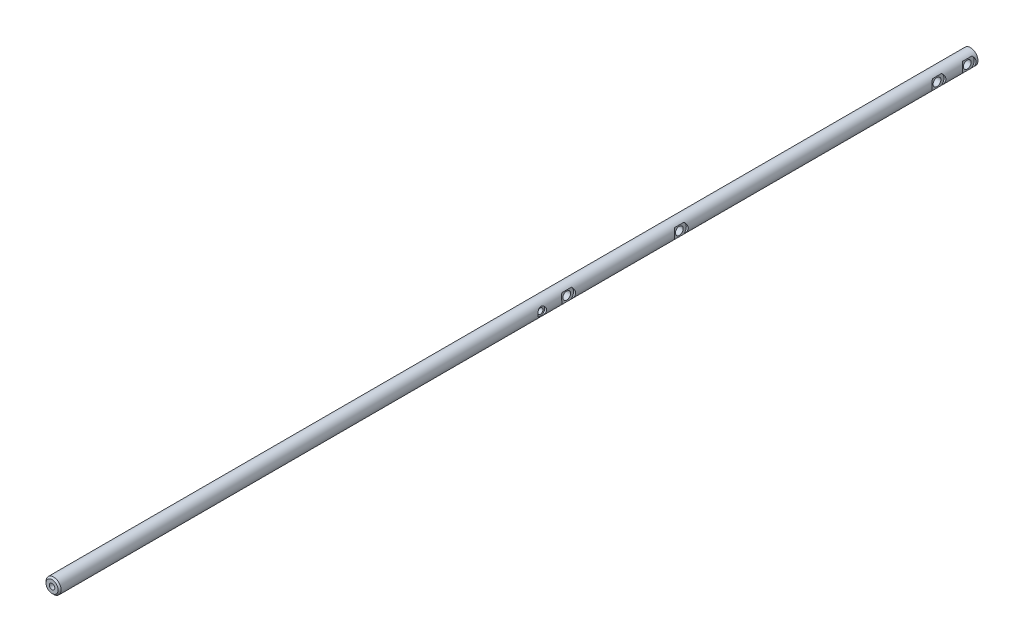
ISO-10303-21;
HEADER;
FILE_DESCRIPTION(('STEP AP214'),'2;1');
FILE_NAME('part.step','',(''),(''),'','','');
FILE_SCHEMA(('AUTOMOTIVE_DESIGN { 1 0 10303 214 1 1 1 1 }'));
ENDSEC;
DATA;
#1=APPLICATION_CONTEXT('core data for automotive mechanical design processes');
#2=APPLICATION_PROTOCOL_DEFINITION('international standard','automotive_design',2000,#1);
#3=PRODUCT_CONTEXT('',#1,'mechanical');
#4=PRODUCT('Part','Part','',(#3));
#5=PRODUCT_RELATED_PRODUCT_CATEGORY('part','',(#4));
#6=PRODUCT_DEFINITION_FORMATION('','',#4);
#7=PRODUCT_DEFINITION_CONTEXT('part definition',#1,'design');
#8=PRODUCT_DEFINITION('design','',#6,#7);
#9=PRODUCT_DEFINITION_SHAPE('','',#8);
#10=(LENGTH_UNIT() NAMED_UNIT(*) SI_UNIT(.MILLI.,.METRE.));
#11=(NAMED_UNIT(*) PLANE_ANGLE_UNIT() SI_UNIT($,.RADIAN.));
#12=(NAMED_UNIT(*) SI_UNIT($,.STERADIAN.) SOLID_ANGLE_UNIT());
#13=UNCERTAINTY_MEASURE_WITH_UNIT(LENGTH_MEASURE(1.E-05),#10,'distance_accuracy_value','');
#14=(GEOMETRIC_REPRESENTATION_CONTEXT(3) GLOBAL_UNCERTAINTY_ASSIGNED_CONTEXT((#13)) GLOBAL_UNIT_ASSIGNED_CONTEXT((#10,
#11,#12)) REPRESENTATION_CONTEXT('',''));
#15=CARTESIAN_POINT('',(0.,0.,0.));
#16=DIRECTION('',(0.,0.,1.));
#17=DIRECTION('',(1.,0.,0.));
#18=AXIS2_PLACEMENT_3D('',#15,#16,#17);
#19=CARTESIAN_POINT('',(0.,0.,578.739));
#20=DIRECTION('',(0.,0.,-1.));
#21=DIRECTION('',(-1.,0.,0.));
#22=AXIS2_PLACEMENT_3D('',#19,#20,#21);
#23=CYLINDRICAL_SURFACE('',#22,4.7625);
#24=CARTESIAN_POINT('',(-4.7625,-1.60704782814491E-11,272.872200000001));
#25=CARTESIAN_POINT('',(-4.76250171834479,0.0937545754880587,272.872197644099));
#26=CARTESIAN_POINT('',(-4.75970697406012,0.187492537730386,272.879857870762));
#27=CARTESIAN_POINT('',(-4.74883616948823,0.372179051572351,272.910181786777));
#28=CARTESIAN_POINT('',(-4.7407604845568,0.463127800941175,272.932844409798));
#29=CARTESIAN_POINT('',(-4.72019795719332,0.639546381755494,272.992274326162));
#30=CARTESIAN_POINT('',(-4.70771928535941,0.725026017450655,273.029015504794));
#31=CARTESIAN_POINT('',(-4.67960297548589,0.888605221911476,273.115431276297));
#32=CARTESIAN_POINT('',(-4.66396455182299,0.96670294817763,273.16510908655));
#33=CARTESIAN_POINT('',(-4.63045168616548,1.11643400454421,273.278072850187));
#34=CARTESIAN_POINT('',(-4.6125168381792,1.18773147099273,273.341785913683));
#35=CARTESIAN_POINT('',(-4.57674015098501,1.31889594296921,273.480104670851));
#36=CARTESIAN_POINT('',(-4.55889833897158,1.37875977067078,273.554713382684));
#37=CARTESIAN_POINT('',(-4.52463700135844,1.48742500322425,273.715907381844));
#38=CARTESIAN_POINT('',(-4.50828949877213,1.53576368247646,273.802821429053));
#39=CARTESIAN_POINT('',(-4.4798010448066,1.61698961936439,273.984232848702));
#40=CARTESIAN_POINT('',(-4.46765853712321,1.64988259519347,274.078727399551));
#41=CARTESIAN_POINT('',(-4.44959767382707,1.69797749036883,274.268763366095));
#42=CARTESIAN_POINT('',(-4.44345581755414,1.71381711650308,274.364121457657));
#43=CARTESIAN_POINT('',(-4.43743527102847,1.72934980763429,274.556324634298));
#44=CARTESIAN_POINT('',(-4.43755420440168,1.72904899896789,274.653169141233));
#45=CARTESIAN_POINT('',(-4.44384811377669,1.7127992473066,274.839888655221));
#46=CARTESIAN_POINT('',(-4.44968724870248,1.69771806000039,274.92985255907));
#47=CARTESIAN_POINT('',(-4.46620813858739,1.65376436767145,275.105873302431));
#48=CARTESIAN_POINT('',(-4.47689057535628,1.62488992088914,275.191929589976));
#49=CARTESIAN_POINT('',(-4.50210772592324,1.55366551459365,275.35952243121));
#50=CARTESIAN_POINT('',(-4.51670873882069,1.51108084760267,275.440948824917));
#51=CARTESIAN_POINT('',(-4.54809404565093,1.4138081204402,275.595758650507));
#52=CARTESIAN_POINT('',(-4.56487905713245,1.35911607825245,275.669139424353));
#53=CARTESIAN_POINT('',(-4.60002246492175,1.23515054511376,275.810601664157));
#54=CARTESIAN_POINT('',(-4.6184136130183,1.16517908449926,275.878064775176));
#55=CARTESIAN_POINT('',(-4.65378991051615,1.0146986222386,276.000476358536));
#56=CARTESIAN_POINT('',(-4.67077487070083,0.934188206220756,276.055423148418));
#57=CARTESIAN_POINT('',(-4.70172488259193,0.763420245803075,276.151865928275));
#58=CARTESIAN_POINT('',(-4.71564563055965,0.673044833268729,276.193168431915));
#59=CARTESIAN_POINT('',(-4.73857256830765,0.485999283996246,276.259782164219));
#60=CARTESIAN_POINT('',(-4.74758079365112,0.389331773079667,276.285100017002));
#61=CARTESIAN_POINT('',(-4.75931617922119,0.197659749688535,276.317865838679));
#62=CARTESIAN_POINT('',(-4.76233603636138,0.102815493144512,276.326147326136));
#63=CARTESIAN_POINT('',(-4.76265074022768,-0.0869438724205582,276.327016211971));
#64=CARTESIAN_POINT('',(-4.75994675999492,-0.181858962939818,276.319606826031));
#65=CARTESIAN_POINT('',(-4.74931100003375,-0.365545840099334,276.289946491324));
#66=CARTESIAN_POINT('',(-4.74156792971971,-0.454416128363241,276.268230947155));
#67=CARTESIAN_POINT('',(-4.72182130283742,-0.627198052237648,276.211268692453));
#68=CARTESIAN_POINT('',(-4.70981719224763,-0.711109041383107,276.176020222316));
#69=CARTESIAN_POINT('',(-4.68231719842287,-0.874274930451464,276.091891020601));
#70=CARTESIAN_POINT('',(-4.66673127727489,-0.953328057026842,276.042649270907));
#71=CARTESIAN_POINT('',(-4.63380601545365,-1.10230592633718,275.932343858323));
#72=CARTESIAN_POINT('',(-4.61646605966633,-1.17222744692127,275.871276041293));
#73=CARTESIAN_POINT('',(-4.58078402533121,-1.30491394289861,275.735152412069));
#74=CARTESIAN_POINT('',(-4.56243855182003,-1.36708593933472,275.659518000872));
#75=CARTESIAN_POINT('',(-4.52773988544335,-1.4779590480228,275.498516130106));
#76=CARTESIAN_POINT('',(-4.51138681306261,-1.52665934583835,275.413148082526));
#77=CARTESIAN_POINT('',(-4.48262715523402,-1.60915598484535,275.234631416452));
#78=CARTESIAN_POINT('',(-4.47022831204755,-1.64292313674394,275.141467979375));
#79=CARTESIAN_POINT('',(-4.45109295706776,-1.69408926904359,274.95020803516));
#80=CARTESIAN_POINT('',(-4.44435324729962,-1.71149749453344,274.852114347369));
#81=CARTESIAN_POINT('',(-4.43770590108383,-1.72865526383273,274.660156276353));
#82=CARTESIAN_POINT('',(-4.43741033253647,-1.729407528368,274.566394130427));
#83=CARTESIAN_POINT('',(-4.44270091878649,-1.71577013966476,274.380155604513));
#84=CARTESIAN_POINT('',(-4.44828658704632,-1.70138173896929,274.287679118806));
#85=CARTESIAN_POINT('',(-4.46439725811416,-1.65863204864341,274.109128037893));
#86=CARTESIAN_POINT('',(-4.47478651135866,-1.6306537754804,274.022948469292));
#87=CARTESIAN_POINT('',(-4.4992630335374,-1.56184677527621,273.856450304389));
#88=CARTESIAN_POINT('',(-4.51335120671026,-1.52101490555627,273.776133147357));
#89=CARTESIAN_POINT('',(-4.54451319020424,-1.42529173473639,273.619287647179));
#90=CARTESIAN_POINT('',(-4.56170088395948,-1.36980066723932,273.54314820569));
#91=CARTESIAN_POINT('',(-4.59670891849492,-1.24728834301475,273.40094017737));
#92=CARTESIAN_POINT('',(-4.61452945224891,-1.18026354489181,273.334874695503));
#93=CARTESIAN_POINT('',(-4.64984991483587,-1.03263324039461,273.211381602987));
#94=CARTESIAN_POINT('',(-4.66729078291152,-0.951521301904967,273.154539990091));
#95=CARTESIAN_POINT('',(-4.69894908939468,-0.780291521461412,273.055329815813));
#96=CARTESIAN_POINT('',(-4.71316662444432,-0.690173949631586,273.012960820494));
#97=CARTESIAN_POINT('',(-4.73694368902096,-0.501900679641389,272.943642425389));
#98=CARTESIAN_POINT('',(-4.74642470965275,-0.403639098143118,272.916951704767));
#99=CARTESIAN_POINT('',(-4.75920062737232,-0.20357747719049,272.881235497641));
#100=CARTESIAN_POINT('',(-4.76249813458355,-0.101778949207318,272.872202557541));
#101=CARTESIAN_POINT('',(-4.7625,-1.60704782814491E-11,272.872200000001));
#102=B_SPLINE_CURVE_WITH_KNOTS('',3,(#24,#25,#26,#27,#28,#29,#30,#31,#32,#33,#34,#35,#36,#37,
#38,#39,#40,#41,#42,#43,#44,#45,#46,#47,#48,#49,#50,#51,#52,#53,#54,#55,#56,#57,#58,#59,#60,#61,
#62,#63,#64,#65,#66,#67,#68,#69,#70,#71,#72,#73,#74,#75,#76,#77,#78,#79,#80,#81,#82,#83,#84,#85,
#86,#87,#88,#89,#90,#91,#92,#93,#94,#95,#96,#97,#98,#99,#100,#101),.UNSPECIFIED.,.T.,.F.,(4,2,2,
2,2,2,2,2,2,2,2,2,2,2,2,2,2,2,2,2,2,2,2,2,2,2,2,2,2,2,2,2,2,2,2,2,2,2,4),(0.,0.280888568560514,
0.561757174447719,0.842107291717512,1.12252719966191,1.41308696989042,1.70372738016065,
2.00458224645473,2.30532564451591,2.59438406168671,2.8833327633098,3.15627507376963,
3.42925581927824,3.70718323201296,3.98520218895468,4.2806070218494,4.57605154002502,
4.87552186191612,5.1748680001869,5.45918203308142,5.7434378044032,6.01761745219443,
6.2918327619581,6.57388985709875,6.85604621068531,7.15348950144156,7.45095077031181,
7.74899093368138,8.04686256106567,8.32674955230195,8.60661339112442,8.87901088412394,
9.15147502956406,9.4375316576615,9.72367627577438,10.0239198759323,10.3241544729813,
10.6292128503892,10.9341424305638),.UNSPECIFIED.);
#103=CARTESIAN_POINT('',(-4.7625,-1.60704782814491E-11,272.872200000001));
#104=VERTEX_POINT('',#103);
#105=EDGE_CURVE('E11',#104,#104,#102,.T.);
#106=ORIENTED_EDGE('',*,*,#105,.T.);
#107=EDGE_LOOP('',(#106));
#108=FACE_BOUND('',#107,.T.);
#109=CARTESIAN_POINT('',(4.7625,0.,271.82064));
#110=CARTESIAN_POINT('',(4.76249476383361,-0.142764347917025,271.820645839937));
#111=CARTESIAN_POINT('',(4.75600874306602,-0.285797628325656,271.831721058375));
#112=CARTESIAN_POINT('',(4.7306830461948,-0.567609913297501,271.875474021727));
#113=CARTESIAN_POINT('',(4.71180885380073,-0.706375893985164,271.908212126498));
#114=CARTESIAN_POINT('',(4.66362570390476,-0.974948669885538,271.993496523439));
#115=CARTESIAN_POINT('',(4.63436829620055,-1.10479600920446,272.045945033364));
#116=CARTESIAN_POINT('',(4.56794601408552,-1.35346278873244,272.168580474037));
#117=CARTESIAN_POINT('',(4.5307838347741,-1.47228596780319,272.238761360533));
#118=CARTESIAN_POINT('',(4.44848879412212,-1.70550659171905,272.400678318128));
#119=CARTESIAN_POINT('',(4.40296938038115,-1.81892387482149,272.493626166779));
#120=CARTESIAN_POINT('',(4.30995925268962,-2.02951733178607,272.695743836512));
#121=CARTESIAN_POINT('',(4.26246614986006,-2.12667306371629,272.804933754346));
#122=CARTESIAN_POINT('',(4.16445197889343,-2.31323710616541,273.051186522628));
#123=CARTESIAN_POINT('',(4.11420640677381,-2.40048631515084,273.190009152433));
#124=CARTESIAN_POINT('',(4.02322248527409,-2.55005667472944,273.483290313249));
#125=CARTESIAN_POINT('',(3.98246927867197,-2.61241689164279,273.637723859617));
#126=CARTESIAN_POINT('',(3.92488579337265,-2.69790642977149,273.921572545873));
#127=CARTESIAN_POINT('',(3.90471039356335,-2.72675733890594,274.048583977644));
#128=CARTESIAN_POINT('',(3.87675163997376,-2.76637233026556,274.306678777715));
#129=CARTESIAN_POINT('',(3.86895415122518,-2.7771570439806,274.43775732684));
#130=CARTESIAN_POINT('',(3.86688901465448,-2.78003249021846,274.700436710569));
#131=CARTESIAN_POINT('',(3.87264299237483,-2.77209334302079,274.832038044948));
#132=CARTESIAN_POINT('',(3.89685489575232,-2.73794545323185,275.09167646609));
#133=CARTESIAN_POINT('',(3.91532191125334,-2.71172363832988,275.219710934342));
#134=CARTESIAN_POINT('',(3.96229054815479,-2.64260614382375,275.468109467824));
#135=CARTESIAN_POINT('',(3.99071689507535,-2.59983529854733,275.588523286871));
#136=CARTESIAN_POINT('',(4.05453539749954,-2.49913916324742,275.820816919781));
#137=CARTESIAN_POINT('',(4.08993017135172,-2.44120817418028,275.932693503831));
#138=CARTESIAN_POINT('',(4.17082741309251,-2.30069629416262,276.16452034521));
#139=CARTESIAN_POINT('',(4.21703164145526,-2.21561733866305,276.282714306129));
#140=CARTESIAN_POINT('',(4.310273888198,-2.02828245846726,276.504308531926));
#141=CARTESIAN_POINT('',(4.35731262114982,-1.9260111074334,276.607695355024));
#142=CARTESIAN_POINT('',(4.45384704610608,-1.69190143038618,276.809759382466));
#143=CARTESIAN_POINT('',(4.50292279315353,-1.55796871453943,276.906258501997));
#144=CARTESIAN_POINT('',(4.56945470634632,-1.3442837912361,277.032769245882));
#145=CARTESIAN_POINT('',(4.59045891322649,-1.2708916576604,277.071912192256));
#146=CARTESIAN_POINT('',(4.62951947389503,-1.12026362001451,277.143700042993));
#147=CARTESIAN_POINT('',(4.64757762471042,-1.04303009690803,277.176348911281));
#148=CARTESIAN_POINT('',(4.679105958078,-0.890522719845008,277.232770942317));
#149=CARTESIAN_POINT('',(4.69280138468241,-0.815460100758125,277.256989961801));
#150=CARTESIAN_POINT('',(4.71674577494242,-0.663068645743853,277.299046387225));
#151=CARTESIAN_POINT('',(4.72699662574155,-0.585741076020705,277.316887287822));
#152=CARTESIAN_POINT('',(4.74374427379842,-0.429488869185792,277.345916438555));
#153=CARTESIAN_POINT('',(4.75024345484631,-0.350565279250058,277.357108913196));
#154=CARTESIAN_POINT('',(4.75929952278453,-0.191852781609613,277.372677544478));
#155=CARTESIAN_POINT('',(4.76185689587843,-0.112063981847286,277.377054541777));
#156=CARTESIAN_POINT('',(4.76332284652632,0.107078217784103,277.379575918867));
#157=CARTESIAN_POINT('',(4.7581067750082,0.246626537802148,277.370670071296));
#158=CARTESIAN_POINT('',(4.73584756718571,0.521784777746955,277.332271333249));
#159=CARTESIAN_POINT('',(4.71880439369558,0.657394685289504,277.302778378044));
#160=CARTESIAN_POINT('',(4.67483103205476,0.919070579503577,277.225260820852));
#161=CARTESIAN_POINT('',(4.64806154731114,1.04525362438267,277.177536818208));
#162=CARTESIAN_POINT('',(4.58677644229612,1.28785424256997,277.065332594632));
#163=CARTESIAN_POINT('',(4.55225910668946,1.40426964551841,277.000848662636));
#164=CARTESIAN_POINT('',(4.47412542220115,1.63713701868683,276.849409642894));
#165=CARTESIAN_POINT('',(4.42993554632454,1.75232642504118,276.760812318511));
#166=CARTESIAN_POINT('',(4.33884655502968,1.96709362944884,276.56738752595));
#167=CARTESIAN_POINT('',(4.29194433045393,2.06665300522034,276.462541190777));
#168=CARTESIAN_POINT('',(4.19392565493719,2.25952090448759,276.22489006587));
#169=CARTESIAN_POINT('',(4.14297609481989,2.35065764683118,276.090241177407));
#170=CARTESIAN_POINT('',(4.04910957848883,2.50890583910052,275.8049770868));
#171=CARTESIAN_POINT('',(4.00618275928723,2.57604688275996,275.654381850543));
#172=CARTESIAN_POINT('',(3.94285403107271,2.67167857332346,275.374359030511));
#173=CARTESIAN_POINT('',(3.91959158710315,2.70538021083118,275.247362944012));
#174=CARTESIAN_POINT('',(3.88520055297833,2.75455061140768,274.988347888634));
#175=CARTESIAN_POINT('',(3.87405685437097,2.77004207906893,274.856335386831));
#176=CARTESIAN_POINT('',(3.86552865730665,2.78193425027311,274.590632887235));
#177=CARTESIAN_POINT('',(3.86818117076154,2.77828359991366,274.456939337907));
#178=CARTESIAN_POINT('',(3.88691666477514,2.75200414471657,274.192364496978));
#179=CARTESIAN_POINT('',(3.90300782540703,2.72936378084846,274.061484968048));
#180=CARTESIAN_POINT('',(3.94566702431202,2.66729547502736,273.809869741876));
#181=CARTESIAN_POINT('',(3.97191183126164,2.62838272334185,273.688948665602));
#182=CARTESIAN_POINT('',(4.03192819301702,2.53535331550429,273.455135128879));
#183=CARTESIAN_POINT('',(4.06570259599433,2.48123090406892,273.342245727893));
#184=CARTESIAN_POINT('',(4.14333217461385,2.34965823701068,273.109026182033));
#185=CARTESIAN_POINT('',(4.18793846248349,2.26989283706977,272.990253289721));
#186=CARTESIAN_POINT('',(4.27884671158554,2.09349733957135,272.766620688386));
#187=CARTESIAN_POINT('',(4.32514997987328,1.99685401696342,272.661772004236));
#188=CARTESIAN_POINT('',(4.42190190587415,1.77341956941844,272.453957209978));
#189=CARTESIAN_POINT('',(4.4720203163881,1.64430090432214,272.353320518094));
#190=CARTESIAN_POINT('',(4.56408914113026,1.36806541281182,272.175182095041));
#191=CARTESIAN_POINT('',(4.60603763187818,1.22094436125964,272.097685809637));
#192=CARTESIAN_POINT('',(4.65834679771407,0.993448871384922,272.003070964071));
#193=CARTESIAN_POINT('',(4.67375403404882,0.918405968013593,271.975571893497));
#194=CARTESIAN_POINT('',(4.70118476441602,0.765680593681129,271.927014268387));
#195=CARTESIAN_POINT('',(4.71321022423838,0.687999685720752,271.905951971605));
#196=CARTESIAN_POINT('',(4.73348001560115,0.530880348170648,271.870638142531));
#197=CARTESIAN_POINT('',(4.74173576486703,0.451447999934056,271.856366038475));
#198=CARTESIAN_POINT('',(4.75425471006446,0.291377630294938,271.834781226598));
#199=CARTESIAN_POINT('',(4.758521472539,0.210740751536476,271.827462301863));
#200=CARTESIAN_POINT('',(4.76131805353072,0.108287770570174,271.822666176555));
#201=CARTESIAN_POINT('',(4.76176092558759,0.0866400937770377,271.821906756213));
#202=CARTESIAN_POINT('',(4.76235229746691,0.0433303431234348,271.820893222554));
#203=CARTESIAN_POINT('',(4.76250079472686,0.0216682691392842,271.820639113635));
#204=CARTESIAN_POINT('',(4.7625,0.,271.82064));
#205=B_SPLINE_CURVE_WITH_KNOTS('',3,(#109,#110,#111,#112,#113,#114,#115,#116,#117,#118,#119,
#120,#121,#122,#123,#124,#125,#126,#127,#128,#129,#130,#131,#132,#133,#134,#135,#136,#137,#138,
#139,#140,#141,#142,#143,#144,#145,#146,#147,#148,#149,#150,#151,#152,#153,#154,#155,#156,#157,
#158,#159,#160,#161,#162,#163,#164,#165,#166,#167,#168,#169,#170,#171,#172,#173,#174,#175,#176,
#177,#178,#179,#180,#181,#182,#183,#184,#185,#186,#187,#188,#189,#190,#191,#192,#193,#194,#195,
#196,#197,#198,#199,#200,#201,#202,#203,#204),.UNSPECIFIED.,.T.,.F.,(4,2,2,2,2,2,2,2,2,2,2,2,2,
2,2,2,2,2,2,2,2,2,2,2,2,2,2,2,2,2,2,2,2,2,2,2,2,2,2,2,2,2,2,2,2,2,2,4),(0.,0.428203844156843,
0.857605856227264,1.28490516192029,1.7120590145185,2.17086068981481,2.63023484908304,
3.14218109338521,3.65332058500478,4.04702686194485,4.44028322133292,4.83416756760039,
5.22833383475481,5.61958299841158,6.01097945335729,6.46753124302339,6.92449489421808,
7.43818849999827,7.6952470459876,7.95214820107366,8.1919652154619,8.43165062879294,
8.67118357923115,8.91068698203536,9.32819924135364,9.74571281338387,10.1566203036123,
10.5676188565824,11.0214837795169,11.4758796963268,11.9846223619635,12.4927354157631,
12.8913565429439,13.2894801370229,13.6886723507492,14.0881077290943,14.475754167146,
14.8635474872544,15.3114262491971,15.7596575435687,16.2707963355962,16.7820553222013,
17.0259367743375,17.2696761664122,17.5126723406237,17.7554510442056,17.8204417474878,
17.8854330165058),.UNSPECIFIED.);
#206=CARTESIAN_POINT('',(4.7625,0.,271.82064));
#207=VERTEX_POINT('',#206);
#208=EDGE_CURVE('E58',#207,#207,#205,.T.);
#209=ORIENTED_EDGE('',*,*,#208,.T.);
#210=EDGE_LOOP('',(#209));
#211=FACE_BOUND('',#210,.T.);
#212=CARTESIAN_POINT('',(-4.7625,0.,184.48655));
#213=CARTESIAN_POINT('',(-4.76249152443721,0.128688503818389,184.486559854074));
#214=CARTESIAN_POINT('',(-4.75722833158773,0.257521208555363,184.496718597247));
#215=CARTESIAN_POINT('',(-4.7366892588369,0.51134420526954,184.536892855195));
#216=CARTESIAN_POINT('',(-4.72139601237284,0.636327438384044,184.566942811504));
#217=CARTESIAN_POINT('',(-4.68239137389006,0.878402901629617,184.645393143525));
#218=CARTESIAN_POINT('',(-4.65871339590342,0.995524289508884,184.693720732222));
#219=CARTESIAN_POINT('',(-4.60508392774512,1.21980506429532,184.806961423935));
#220=CARTESIAN_POINT('',(-4.57513267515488,1.32696482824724,184.871873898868));
#221=CARTESIAN_POINT('',(-4.50945230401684,1.53589838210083,185.021089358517));
#222=CARTESIAN_POINT('',(-4.47347763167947,1.63690351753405,185.106358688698));
#223=CARTESIAN_POINT('',(-4.40055720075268,1.82389564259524,185.291782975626));
#224=CARTESIAN_POINT('',(-4.36361067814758,1.90987038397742,185.39194995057));
#225=CARTESIAN_POINT('',(-4.28933609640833,2.07161025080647,185.61435293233));
#226=CARTESIAN_POINT('',(-4.25223634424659,2.14591256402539,185.737735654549));
#227=CARTESIAN_POINT('',(-4.18600987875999,2.27241581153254,185.997448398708));
#228=CARTESIAN_POINT('',(-4.1568772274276,2.32463322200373,186.133768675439));
#229=CARTESIAN_POINT('',(-4.12336816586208,2.38321017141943,186.340580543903));
#230=CARTESIAN_POINT('',(-4.1140543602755,2.39920643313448,186.407668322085));
#231=CARTESIAN_POINT('',(-4.09858414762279,2.42554161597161,186.543289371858));
#232=CARTESIAN_POINT('',(-4.09242601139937,2.43588363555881,186.611821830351));
#233=CARTESIAN_POINT('',(-4.08354926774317,2.45073618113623,186.749690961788));
#234=CARTESIAN_POINT('',(-4.08082825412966,2.4552507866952,186.8190270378));
#235=CARTESIAN_POINT('',(-4.07893457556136,2.45839303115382,186.957858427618));
#236=CARTESIAN_POINT('',(-4.07976153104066,2.45702129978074,187.027353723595));
#237=CARTESIAN_POINT('',(-4.08687198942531,2.44519972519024,187.217113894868));
#238=CARTESIAN_POINT('',(-4.09673679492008,2.42878940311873,187.336938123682));
#239=CARTESIAN_POINT('',(-4.12586272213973,2.37896289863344,187.571728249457));
#240=CARTESIAN_POINT('',(-4.14512718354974,2.34554067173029,187.686692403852));
#241=CARTESIAN_POINT('',(-4.19126503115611,2.26208240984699,187.911880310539));
#242=CARTESIAN_POINT('',(-4.21830354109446,2.2116812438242,188.021933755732));
#243=CARTESIAN_POINT('',(-4.27696982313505,2.09598116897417,188.232558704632));
#244=CARTESIAN_POINT('',(-4.30859965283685,2.03067557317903,188.333125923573));
#245=CARTESIAN_POINT('',(-4.37808235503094,1.8766628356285,188.536352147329));
#246=CARTESIAN_POINT('',(-4.41619602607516,1.78597977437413,188.63743014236));
#247=CARTESIAN_POINT('',(-4.49088662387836,1.58885410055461,188.823627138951));
#248=CARTESIAN_POINT('',(-4.52746271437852,1.48240305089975,188.908737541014));
#249=CARTESIAN_POINT('',(-4.5972888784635,1.24973338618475,189.064812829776));
#250=CARTESIAN_POINT('',(-4.63026402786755,1.12277098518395,189.134802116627));
#251=CARTESIAN_POINT('',(-4.68677063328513,0.856746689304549,189.251836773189));
#252=CARTESIAN_POINT('',(-4.71031003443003,0.717695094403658,189.298901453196));
#253=CARTESIAN_POINT('',(-4.74355453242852,0.444295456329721,189.364680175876));
#254=CARTESIAN_POINT('',(-4.75427816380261,0.310577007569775,189.385490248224));
#255=CARTESIAN_POINT('',(-4.76422599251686,0.0411383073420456,189.404809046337));
#256=CARTESIAN_POINT('',(-4.76345618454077,-0.0945808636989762,189.403329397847));
#257=CARTESIAN_POINT('',(-4.75107225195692,-0.352065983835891,189.379246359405));
#258=CARTESIAN_POINT('',(-4.74037119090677,-0.474049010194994,189.358421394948));
#259=CARTESIAN_POINT('',(-4.71043184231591,-0.712520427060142,189.299095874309));
#260=CARTESIAN_POINT('',(-4.69119263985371,-0.829008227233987,189.260593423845));
#261=CARTESIAN_POINT('',(-4.64524813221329,-1.05686265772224,189.166100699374));
#262=CARTESIAN_POINT('',(-4.61835497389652,-1.16800557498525,189.109665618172));
#263=CARTESIAN_POINT('',(-4.55962818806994,-1.37959135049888,188.98142752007));
#264=CARTESIAN_POINT('',(-4.52779252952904,-1.48002978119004,188.909618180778));
#265=CARTESIAN_POINT('',(-4.45833490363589,-1.6783311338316,188.744169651));
#266=CARTESIAN_POINT('',(-4.4204546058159,-1.77486580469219,188.649044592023));
#267=CARTESIAN_POINT('',(-4.34548726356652,-1.95124318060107,188.444006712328));
#268=CARTESIAN_POINT('',(-4.30840087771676,-2.0310724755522,188.33408212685));
#269=CARTESIAN_POINT('',(-4.23706820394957,-2.17613612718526,188.094724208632));
#270=CARTESIAN_POINT('',(-4.2031054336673,-2.24027539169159,187.96453490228));
#271=CARTESIAN_POINT('',(-4.14556867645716,-2.34505616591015,187.692921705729));
#272=CARTESIAN_POINT('',(-4.12198054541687,-2.38572969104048,187.55151342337));
#273=CARTESIAN_POINT('',(-4.09094729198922,-2.4385265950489,187.276167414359));
#274=CARTESIAN_POINT('',(-4.08215232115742,-2.45304721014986,187.142845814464));
#275=CARTESIAN_POINT('',(-4.07789402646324,-2.46012575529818,186.875436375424));
#276=CARTESIAN_POINT('',(-4.08242353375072,-2.45269549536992,186.741348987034));
#277=CARTESIAN_POINT('',(-4.10283603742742,-2.41835835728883,186.491461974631));
#278=CARTESIAN_POINT('',(-4.11744737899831,-2.39362904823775,186.375244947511));
#279=CARTESIAN_POINT('',(-4.15478446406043,-2.32821437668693,186.148776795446));
#280=CARTESIAN_POINT('',(-4.17751297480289,-2.28752357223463,186.038527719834));
#281=CARTESIAN_POINT('',(-4.23035299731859,-2.18834794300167,185.818985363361));
#282=CARTESIAN_POINT('',(-4.26085451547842,-2.12886104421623,185.710241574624));
#283=CARTESIAN_POINT('',(-4.32522353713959,-1.99483737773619,185.503556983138));
#284=CARTESIAN_POINT('',(-4.3590928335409,-1.92029257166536,185.405621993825));
#285=CARTESIAN_POINT('',(-4.43174526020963,-1.7467118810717,185.209828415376));
#286=CARTESIAN_POINT('',(-4.47058531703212,-1.64574019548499,185.113696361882));
#287=CARTESIAN_POINT('',(-4.54477351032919,-1.42817103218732,184.939292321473));
#288=CARTESIAN_POINT('',(-4.58011959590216,-1.31156447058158,184.86103078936));
#289=CARTESIAN_POINT('',(-4.6440936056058,-1.06320221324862,184.723862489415));
#290=CARTESIAN_POINT('',(-4.67261532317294,-0.931249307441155,184.665256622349));
#291=CARTESIAN_POINT('',(-4.70732123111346,-0.726204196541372,184.595187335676));
#292=CARTESIAN_POINT('',(-4.7175396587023,-0.656718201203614,184.574811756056));
#293=CARTESIAN_POINT('',(-4.7350070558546,-0.515879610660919,184.540216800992));
#294=CARTESIAN_POINT('',(-4.7422577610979,-0.444528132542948,184.525993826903));
#295=CARTESIAN_POINT('',(-4.75273057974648,-0.311071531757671,184.505523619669));
#296=CARTESIAN_POINT('',(-4.7563851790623,-0.249130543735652,184.498417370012));
#297=CARTESIAN_POINT('',(-4.76127197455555,-0.124804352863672,184.488928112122));
#298=CARTESIAN_POINT('',(-4.7625041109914,-0.0624191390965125,184.486545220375));
#299=CARTESIAN_POINT('',(-4.7625,0.,184.48655));
#300=B_SPLINE_CURVE_WITH_KNOTS('',3,(#212,#213,#214,#215,#216,#217,#218,#219,#220,#221,#222,
#223,#224,#225,#226,#227,#228,#229,#230,#231,#232,#233,#234,#235,#236,#237,#238,#239,#240,#241,
#242,#243,#244,#245,#246,#247,#248,#249,#250,#251,#252,#253,#254,#255,#256,#257,#258,#259,#260,
#261,#262,#263,#264,#265,#266,#267,#268,#269,#270,#271,#272,#273,#274,#275,#276,#277,#278,#279,
#280,#281,#282,#283,#284,#285,#286,#287,#288,#289,#290,#291,#292,#293,#294,#295,#296,#297,#298,
#299),.UNSPECIFIED.,.T.,.F.,(4,2,2,2,2,2,2,2,2,2,2,2,2,2,2,2,2,2,2,2,2,2,2,2,2,2,2,2,2,2,2,2,2,
2,2,2,2,2,2,2,2,2,2,4),(0.,0.385823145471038,0.772316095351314,1.15728584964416,
1.54224102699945,1.95153023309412,2.36115142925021,2.80515698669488,3.24883071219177,
3.45735369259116,3.66576228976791,3.87402490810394,4.0822652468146,4.44442134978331,
4.80670622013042,5.17734031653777,5.54814102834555,5.9694498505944,6.39098492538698,
6.83462090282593,7.27788253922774,7.68289304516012,8.08769231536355,8.45860984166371,
8.82956712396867,9.21055720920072,9.59170427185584,10.012067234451,10.4327663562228,
10.8775130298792,11.3216514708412,11.7224810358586,12.1230949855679,12.4806815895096,
12.8383902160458,13.2198494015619,13.6015127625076,14.0337031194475,14.4661456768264,
14.9049346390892,15.1240393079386,15.3430156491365,15.5301508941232,15.7172907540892),.UNSPECIFIED.);
#301=CARTESIAN_POINT('',(-4.7625,0.,184.48655));
#302=VERTEX_POINT('',#301);
#303=EDGE_CURVE('E158',#302,#302,#300,.T.);
#304=ORIENTED_EDGE('',*,*,#303,.T.);
#305=EDGE_LOOP('',(#304));
#306=FACE_BOUND('',#305,.T.);
#307=DIRECTION('',(0.,0.,-1.));
#308=VECTOR('',#307,1.);
#309=CARTESIAN_POINT('',(3.4925,-3.23787739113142,578.739));
#310=LINE('',#309,#308);
#311=CARTESIAN_POINT('',(3.4925,-3.23787739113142,184.014772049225));
#312=VERTEX_POINT('',#311);
#313=CARTESIAN_POINT('',(3.4925,-3.23787739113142,189.873227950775));
#314=VERTEX_POINT('',#313);
#315=EDGE_CURVE('E138',#312,#314,#310,.F.);
#316=ORIENTED_EDGE('',*,*,#315,.T.);
#317=CARTESIAN_POINT('',(3.4925,-3.23787739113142,189.873227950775));
#318=CARTESIAN_POINT('',(3.56198957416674,-3.16292435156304,189.956056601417));
#319=CARTESIAN_POINT('',(3.63037598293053,-3.08431752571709,190.036575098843));
#320=CARTESIAN_POINT('',(3.7641410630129,-2.91957643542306,190.192573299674));
#321=CARTESIAN_POINT('',(3.82951490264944,-2.83343068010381,190.268044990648));
#322=CARTESIAN_POINT('',(3.95678717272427,-2.65283633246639,190.413906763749));
#323=CARTESIAN_POINT('',(4.01865014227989,-2.55832161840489,190.484246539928));
#324=CARTESIAN_POINT('',(4.13721365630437,-2.36179125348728,190.618280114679));
#325=CARTESIAN_POINT('',(4.19391736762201,-2.25978027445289,190.681977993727));
#326=CARTESIAN_POINT('',(4.33262087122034,-1.98621927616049,190.837102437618));
#327=CARTESIAN_POINT('',(4.40998633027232,-1.80893254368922,190.922920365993));
#328=CARTESIAN_POINT('',(4.51077483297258,-1.53102632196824,191.034250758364));
#329=CARTESIAN_POINT('',(4.54180344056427,-1.43649902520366,191.06843502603));
#330=CARTESIAN_POINT('',(4.59830103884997,-1.24382094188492,191.130569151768));
#331=CARTESIAN_POINT('',(4.62377287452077,-1.14567203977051,191.158522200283));
#332=CARTESIAN_POINT('',(4.66886329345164,-0.945389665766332,191.207942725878));
#333=CARTESIAN_POINT('',(4.68842360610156,-0.84322707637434,191.22934566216));
#334=CARTESIAN_POINT('',(4.72091218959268,-0.636646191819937,191.264866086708));
#335=CARTESIAN_POINT('',(4.73384363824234,-0.532229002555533,191.278987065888));
#336=CARTESIAN_POINT('',(4.75277642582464,-0.321975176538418,191.299653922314));
#337=CARTESIAN_POINT('',(4.75877482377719,-0.216137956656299,191.306196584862));
#338=CARTESIAN_POINT('',(4.76367838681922,-0.0041115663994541,191.311545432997));
#339=CARTESIAN_POINT('',(4.76258437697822,0.10207756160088,191.310352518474));
#340=CARTESIAN_POINT('',(4.75392539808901,0.300228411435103,191.300905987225));
#341=CARTESIAN_POINT('',(4.74720586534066,0.392272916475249,191.293574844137));
#342=CARTESIAN_POINT('',(4.7285328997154,0.575197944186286,191.273186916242));
#343=CARTESIAN_POINT('',(4.71657786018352,0.666078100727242,191.260128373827));
#344=CARTESIAN_POINT('',(4.67318031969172,0.935869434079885,191.212677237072));
#345=CARTESIAN_POINT('',(4.63419210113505,1.11221474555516,191.169994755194));
#346=CARTESIAN_POINT('',(4.53780043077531,1.45686909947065,191.064065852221));
#347=CARTESIAN_POINT('',(4.48007331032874,1.62497225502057,191.000457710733));
#348=CARTESIAN_POINT('',(4.34955407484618,1.94760461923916,190.855829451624));
#349=CARTESIAN_POINT('',(4.27672760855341,2.10210171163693,190.774769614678));
#350=CARTESIAN_POINT('',(4.09564277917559,2.440091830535,190.571650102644));
#351=CARTESIAN_POINT('',(3.98330609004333,2.61840315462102,190.444582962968));
#352=CARTESIAN_POINT('',(3.80517406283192,2.86571872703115,190.239949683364));
#353=CARTESIAN_POINT('',(3.74435564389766,2.94462691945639,190.169592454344));
#354=CARTESIAN_POINT('',(3.62018082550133,3.09600447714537,190.024569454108));
#355=CARTESIAN_POINT('',(3.55682760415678,3.16848156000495,189.949909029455));
#356=CARTESIAN_POINT('',(3.4925,3.23787739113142,189.873227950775));
#357=B_SPLINE_CURVE_WITH_KNOTS('',3,(#317,#318,#319,#320,#321,#322,#323,#324,#325,#326,#327,
#328,#329,#330,#331,#332,#333,#334,#335,#336,#337,#338,#339,#340,#341,#342,#343,#344,#345,#346,
#347,#348,#349,#350,#351,#352,#353,#354,#355,#356),.UNSPECIFIED.,.F.,.F.,(4,2,2,2,2,2,2,2,2,2,2,
2,2,2,2,2,2,2,2,4),(0.,0.394660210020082,0.789932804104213,1.18866795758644,1.58715668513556,
2.2190242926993,2.53430536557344,2.84942463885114,3.16755573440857,3.48553417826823,
3.80364745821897,4.12172373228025,4.39912255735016,4.67660656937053,5.23073350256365,
5.794992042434,6.36054864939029,7.09555669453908,7.46124278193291,7.82648392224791),.UNSPECIFIED.);
#358=CARTESIAN_POINT('',(3.4925,3.23787739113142,189.873227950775));
#359=VERTEX_POINT('',#358);
#360=EDGE_CURVE('E152',#314,#359,#357,.T.);
#361=ORIENTED_EDGE('',*,*,#360,.T.);
#362=DIRECTION('',(0.,0.,-1.));
#363=VECTOR('',#362,1.);
#364=CARTESIAN_POINT('',(3.4925,3.23787739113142,578.739));
#365=LINE('',#364,#363);
#366=CARTESIAN_POINT('',(3.4925,3.23787739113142,184.014772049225));
#367=VERTEX_POINT('',#366);
#368=EDGE_CURVE('E144',#359,#367,#365,.T.);
#369=ORIENTED_EDGE('',*,*,#368,.T.);
#370=CARTESIAN_POINT('',(3.4925,3.23787739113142,184.014772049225));
#371=CARTESIAN_POINT('',(3.56197524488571,3.16294078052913,183.931960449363));
#372=CARTESIAN_POINT('',(3.63034826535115,3.08434986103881,183.851457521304));
#373=CARTESIAN_POINT('',(3.7640887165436,2.91964270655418,183.695487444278));
#374=CARTESIAN_POINT('',(3.82945128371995,2.83351490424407,183.620028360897));
#375=CARTESIAN_POINT('',(3.95672677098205,2.6529281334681,183.474162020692));
#376=CARTESIAN_POINT('',(4.01860263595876,2.5584001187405,183.403807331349));
#377=CARTESIAN_POINT('',(4.13719353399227,2.3618248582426,183.269742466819));
#378=CARTESIAN_POINT('',(4.19391179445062,2.25978238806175,183.206028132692));
#379=CARTESIAN_POINT('',(4.33264583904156,1.98618411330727,183.05086980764));
#380=CARTESIAN_POINT('',(4.4100107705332,1.80893249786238,182.965053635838));
#381=CARTESIAN_POINT('',(4.5443220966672,1.43845859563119,182.816692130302));
#382=CARTESIAN_POINT('',(4.60134911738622,1.24530319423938,182.754054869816));
#383=CARTESIAN_POINT('',(4.68409375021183,0.877714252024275,182.6633642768));
#384=CARTESIAN_POINT('',(4.71330190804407,0.70504262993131,182.63144677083));
#385=CARTESIAN_POINT('',(4.7427176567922,0.442544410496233,182.59932437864));
#386=CARTESIAN_POINT('',(4.75012363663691,0.354392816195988,182.5912424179));
#387=CARTESIAN_POINT('',(4.76001411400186,0.177495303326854,182.580450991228));
#388=CARTESIAN_POINT('',(4.76249999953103,0.0887495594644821,182.577740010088));
#389=CARTESIAN_POINT('',(4.76250000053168,-0.100617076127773,182.577739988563));
#390=CARTESIAN_POINT('',(4.75930484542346,-0.201239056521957,182.5812244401));
#391=CARTESIAN_POINT('',(4.74659861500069,-0.401607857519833,182.595089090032));
#392=CARTESIAN_POINT('',(4.73708689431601,-0.501354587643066,182.605469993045));
#393=CARTESIAN_POINT('',(4.71196104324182,-0.699111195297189,182.632918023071));
#394=CARTESIAN_POINT('',(4.69634885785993,-0.797121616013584,182.649983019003));
#395=CARTESIAN_POINT('',(4.65935698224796,-0.990724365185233,182.690472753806));
#396=CARTESIAN_POINT('',(4.63797471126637,-1.08631559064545,182.713900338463));
#397=CARTESIAN_POINT('',(4.56613397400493,-1.36705645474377,182.792750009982));
#398=CARTESIAN_POINT('',(4.50776169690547,-1.54782291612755,182.85697767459));
#399=CARTESIAN_POINT('',(4.37356816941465,-1.89421220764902,183.005481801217));
#400=CARTESIAN_POINT('',(4.29770207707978,-2.05979456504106,183.08980980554));
#401=CARTESIAN_POINT('',(4.11092436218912,-2.4148806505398,183.299096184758));
#402=CARTESIAN_POINT('',(3.99602769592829,-2.59943546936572,183.428919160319));
#403=CARTESIAN_POINT('',(3.813434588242,-2.8548256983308,183.638509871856));
#404=CARTESIAN_POINT('',(3.75106970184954,-2.93616438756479,183.710605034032));
#405=CARTESIAN_POINT('',(3.62364371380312,-3.09203825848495,183.85935107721));
#406=CARTESIAN_POINT('',(3.55858623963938,-3.16658218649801,183.935995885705));
#407=CARTESIAN_POINT('',(3.49249999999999,-3.23787739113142,184.014772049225));
#408=B_SPLINE_CURVE_WITH_KNOTS('',3,(#370,#371,#372,#373,#374,#375,#376,#377,#378,#379,#380,
#381,#382,#383,#384,#385,#386,#387,#388,#389,#390,#391,#392,#393,#394,#395,#396,#397,#398,#399,
#400,#401,#402,#403,#404,#405,#406,#407),.UNSPECIFIED.,.F.,.F.,(4,2,2,2,2,2,2,2,2,2,2,2,2,2,2,2,
2,2,4),(0.,0.39458074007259,0.789778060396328,1.18859301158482,1.58715665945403,
2.21926290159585,2.8488346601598,3.38046809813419,3.64670204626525,3.91286087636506,
4.21461024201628,4.5163904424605,4.8180745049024,5.11989372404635,5.71855562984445,
6.31876948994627,7.07479833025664,7.45050732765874,7.82572566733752),.UNSPECIFIED.);
#409=EDGE_CURVE('E132',#367,#312,#408,.T.);
#410=ORIENTED_EDGE('',*,*,#409,.T.);
#411=EDGE_LOOP('',(#316,#361,#369,#410));
#412=FACE_BOUND('',#411,.T.);
#413=CARTESIAN_POINT('',(-4.7625,0.,22.11705));
#414=CARTESIAN_POINT('',(-4.76249152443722,0.128688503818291,22.117059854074));
#415=CARTESIAN_POINT('',(-4.75722833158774,0.257521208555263,22.1272185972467));
#416=CARTESIAN_POINT('',(-4.73668925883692,0.511344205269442,22.1673928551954));
#417=CARTESIAN_POINT('',(-4.72139601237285,0.636327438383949,22.1974428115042));
#418=CARTESIAN_POINT('',(-4.68239137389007,0.878402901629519,22.2758931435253));
#419=CARTESIAN_POINT('',(-4.65871339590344,0.995524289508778,22.324220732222));
#420=CARTESIAN_POINT('',(-4.60508392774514,1.21980506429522,22.4374614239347));
#421=CARTESIAN_POINT('',(-4.57513267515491,1.32696482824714,22.5023738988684));
#422=CARTESIAN_POINT('',(-4.50945230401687,1.53589838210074,22.6515893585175));
#423=CARTESIAN_POINT('',(-4.4734776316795,1.63690351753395,22.7368586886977));
#424=CARTESIAN_POINT('',(-4.40055720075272,1.82389564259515,22.9222829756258));
#425=CARTESIAN_POINT('',(-4.36361067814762,1.90987038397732,23.0224499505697));
#426=CARTESIAN_POINT('',(-4.28933609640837,2.07161025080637,23.2448529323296));
#427=CARTESIAN_POINT('',(-4.25223634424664,2.14591256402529,23.3682356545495));
#428=CARTESIAN_POINT('',(-4.18600987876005,2.27241581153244,23.6279483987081));
#429=CARTESIAN_POINT('',(-4.15687722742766,2.32463322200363,23.7642686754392));
#430=CARTESIAN_POINT('',(-4.12336816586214,2.38321017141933,23.971080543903));
#431=CARTESIAN_POINT('',(-4.11405436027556,2.39920643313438,24.0381683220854));
#432=CARTESIAN_POINT('',(-4.09858414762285,2.42554161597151,24.1737893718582));
#433=CARTESIAN_POINT('',(-4.09242601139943,2.43588363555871,24.2423218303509));
#434=CARTESIAN_POINT('',(-4.08354926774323,2.45073618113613,24.3801909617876));
#435=CARTESIAN_POINT('',(-4.08082825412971,2.4552507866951,24.4495270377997));
#436=CARTESIAN_POINT('',(-4.07893457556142,2.45839303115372,24.5883584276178));
#437=CARTESIAN_POINT('',(-4.07976153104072,2.45702129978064,24.6578537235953));
#438=CARTESIAN_POINT('',(-4.08687198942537,2.44519972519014,24.8476138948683));
#439=CARTESIAN_POINT('',(-4.09673679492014,2.42878940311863,24.9674381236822));
#440=CARTESIAN_POINT('',(-4.12586272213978,2.37896289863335,25.2022282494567));
#441=CARTESIAN_POINT('',(-4.1451271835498,2.3455406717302,25.3171924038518));
#442=CARTESIAN_POINT('',(-4.19126503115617,2.26208240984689,25.5423803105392));
#443=CARTESIAN_POINT('',(-4.21830354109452,2.2116812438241,25.6524337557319));
#444=CARTESIAN_POINT('',(-4.2769698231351,2.09598116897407,25.8630587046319));
#445=CARTESIAN_POINT('',(-4.30859965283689,2.03067557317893,25.9636259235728));
#446=CARTESIAN_POINT('',(-4.37808235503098,1.8766628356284,26.1668521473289));
#447=CARTESIAN_POINT('',(-4.4161960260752,1.78597977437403,26.26793014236));
#448=CARTESIAN_POINT('',(-4.49088662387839,1.58885410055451,26.4541271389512));
#449=CARTESIAN_POINT('',(-4.52746271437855,1.48240305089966,26.539237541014));
#450=CARTESIAN_POINT('',(-4.59728887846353,1.24973338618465,26.6953128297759));
#451=CARTESIAN_POINT('',(-4.63026402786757,1.12277098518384,26.765302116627));
#452=CARTESIAN_POINT('',(-4.68677063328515,0.856746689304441,26.8823367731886));
#453=CARTESIAN_POINT('',(-4.71031003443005,0.717695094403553,26.9294014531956));
#454=CARTESIAN_POINT('',(-4.74355453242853,0.444295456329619,26.9951801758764));
#455=CARTESIAN_POINT('',(-4.75427816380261,0.310577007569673,27.0159902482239));
#456=CARTESIAN_POINT('',(-4.76422599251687,0.0411383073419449,27.035309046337));
#457=CARTESIAN_POINT('',(-4.76345618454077,-0.0945808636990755,27.0338293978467));
#458=CARTESIAN_POINT('',(-4.75107225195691,-0.352065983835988,27.0097463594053));
#459=CARTESIAN_POINT('',(-4.74037119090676,-0.474049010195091,26.9889213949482));
#460=CARTESIAN_POINT('',(-4.7104318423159,-0.712520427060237,26.929595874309));
#461=CARTESIAN_POINT('',(-4.6911926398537,-0.829008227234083,26.8910934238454));
#462=CARTESIAN_POINT('',(-4.64524813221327,-1.05686265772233,26.796600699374));
#463=CARTESIAN_POINT('',(-4.6183549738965,-1.16800557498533,26.7401656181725));
#464=CARTESIAN_POINT('',(-4.55962818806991,-1.37959135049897,26.6119275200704));
#465=CARTESIAN_POINT('',(-4.52779252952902,-1.48002978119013,26.5401181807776));
#466=CARTESIAN_POINT('',(-4.45833490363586,-1.6783311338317,26.3746696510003));
#467=CARTESIAN_POINT('',(-4.42045460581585,-1.77486580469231,26.2795445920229));
#468=CARTESIAN_POINT('',(-4.34548726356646,-1.95124318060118,26.0745067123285));
#469=CARTESIAN_POINT('',(-4.30840087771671,-2.03107247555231,25.9645821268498));
#470=CARTESIAN_POINT('',(-4.23706820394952,-2.17613612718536,25.7252242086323));
#471=CARTESIAN_POINT('',(-4.20310543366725,-2.24027539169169,25.5950349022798));
#472=CARTESIAN_POINT('',(-4.1455686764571,-2.34505616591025,25.3234217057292));
#473=CARTESIAN_POINT('',(-4.12198054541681,-2.38572969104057,25.1820134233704));
#474=CARTESIAN_POINT('',(-4.09094729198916,-2.43852659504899,24.906667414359));
#475=CARTESIAN_POINT('',(-4.08215232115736,-2.45304721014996,24.7733458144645));
#476=CARTESIAN_POINT('',(-4.07789402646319,-2.46012575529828,24.5059363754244));
#477=CARTESIAN_POINT('',(-4.08242353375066,-2.45269549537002,24.3718489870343));
#478=CARTESIAN_POINT('',(-4.10283603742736,-2.41835835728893,24.1219619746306));
#479=CARTESIAN_POINT('',(-4.11744737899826,-2.39362904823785,24.0057449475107));
#480=CARTESIAN_POINT('',(-4.15478446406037,-2.32821437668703,23.7792767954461));
#481=CARTESIAN_POINT('',(-4.17751297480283,-2.28752357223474,23.6690277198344));
#482=CARTESIAN_POINT('',(-4.23035299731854,-2.18834794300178,23.4494853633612));
#483=CARTESIAN_POINT('',(-4.26085451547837,-2.12886104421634,23.3407415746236));
#484=CARTESIAN_POINT('',(-4.32522353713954,-1.9948373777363,23.134056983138));
#485=CARTESIAN_POINT('',(-4.35909283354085,-1.92029257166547,23.0361219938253));
#486=CARTESIAN_POINT('',(-4.43174526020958,-1.7467118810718,22.8403284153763));
#487=CARTESIAN_POINT('',(-4.47058531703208,-1.6457401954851,22.7441963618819));
#488=CARTESIAN_POINT('',(-4.54477351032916,-1.42817103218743,22.5697923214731));
#489=CARTESIAN_POINT('',(-4.58011959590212,-1.31156447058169,22.49153078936));
#490=CARTESIAN_POINT('',(-4.64409360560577,-1.06320221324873,22.3543624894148));
#491=CARTESIAN_POINT('',(-4.67261532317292,-0.931249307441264,22.2957566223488));
#492=CARTESIAN_POINT('',(-4.70732123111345,-0.726204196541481,22.225687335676));
#493=CARTESIAN_POINT('',(-4.71753965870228,-0.656718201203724,22.2053117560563));
#494=CARTESIAN_POINT('',(-4.73500705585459,-0.51587961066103,22.1707168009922));
#495=CARTESIAN_POINT('',(-4.74225776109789,-0.444528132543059,22.1564938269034));
#496=CARTESIAN_POINT('',(-4.75273057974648,-0.311071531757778,22.1360236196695));
#497=CARTESIAN_POINT('',(-4.7563851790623,-0.249130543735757,22.1289173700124));
#498=CARTESIAN_POINT('',(-4.76127197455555,-0.124804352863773,22.1194281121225));
#499=CARTESIAN_POINT('',(-4.7625041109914,-0.062419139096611,22.1170452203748));
#500=CARTESIAN_POINT('',(-4.7625,0.,22.11705));
#501=B_SPLINE_CURVE_WITH_KNOTS('',3,(#413,#414,#415,#416,#417,#418,#419,#420,#421,#422,#423,
#424,#425,#426,#427,#428,#429,#430,#431,#432,#433,#434,#435,#436,#437,#438,#439,#440,#441,#442,
#443,#444,#445,#446,#447,#448,#449,#450,#451,#452,#453,#454,#455,#456,#457,#458,#459,#460,#461,
#462,#463,#464,#465,#466,#467,#468,#469,#470,#471,#472,#473,#474,#475,#476,#477,#478,#479,#480,
#481,#482,#483,#484,#485,#486,#487,#488,#489,#490,#491,#492,#493,#494,#495,#496,#497,#498,#499,
#500),.UNSPECIFIED.,.T.,.F.,(4,2,2,2,2,2,2,2,2,2,2,2,2,2,2,2,2,2,2,2,2,2,2,2,2,2,2,2,2,2,2,2,2,
2,2,2,2,2,2,2,2,2,2,4),(0.,0.385823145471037,0.772316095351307,1.15728584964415,
1.54224102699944,1.95153023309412,2.3611514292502,2.80515698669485,3.24883071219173,
3.45735369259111,3.66576228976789,3.87402490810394,4.08226524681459,4.44442134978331,
4.80670622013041,5.17734031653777,5.54814102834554,5.9694498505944,6.39098492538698,
6.83462090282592,7.27788253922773,7.6828930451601,8.08769231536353,8.45860984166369,
8.82956712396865,9.21055720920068,9.59170427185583,10.012067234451,10.4327663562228,
10.8775130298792,11.3216514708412,11.7224810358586,12.1230949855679,12.4806815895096,
12.8383902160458,13.2198494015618,13.6015127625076,14.0337031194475,14.4661456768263,
14.9049346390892,15.1240393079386,15.3430156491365,15.5301508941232,15.7172907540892),.UNSPECIFIED.);
#502=CARTESIAN_POINT('',(-4.7625,0.,22.11705));
#503=VERTEX_POINT('',#502);
#504=EDGE_CURVE('E139',#503,#503,#501,.T.);
#505=ORIENTED_EDGE('',*,*,#504,.T.);
#506=EDGE_LOOP('',(#505));
#507=FACE_BOUND('',#506,.T.);
#508=DIRECTION('',(0.,0.,-1.));
#509=VECTOR('',#508,1.);
#510=CARTESIAN_POINT('',(3.4925,-3.23787739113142,578.739));
#511=LINE('',#510,#509);
#512=CARTESIAN_POINT('',(3.4925,-3.23787739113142,21.6452720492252));
#513=VERTEX_POINT('',#512);
#514=CARTESIAN_POINT('',(3.4925,-3.23787739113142,27.5037279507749));
#515=VERTEX_POINT('',#514);
#516=EDGE_CURVE('E612',#513,#515,#511,.F.);
#517=ORIENTED_EDGE('',*,*,#516,.T.);
#518=CARTESIAN_POINT('',(3.4925,-3.23787739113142,27.5037279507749));
#519=CARTESIAN_POINT('',(3.56198957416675,-3.16292435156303,27.5865566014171));
#520=CARTESIAN_POINT('',(3.63037598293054,-3.08431752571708,27.6670750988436));
#521=CARTESIAN_POINT('',(3.76414106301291,-2.91957643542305,27.8230732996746));
#522=CARTESIAN_POINT('',(3.82951490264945,-2.8334306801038,27.8985449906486));
#523=CARTESIAN_POINT('',(3.95678717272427,-2.65283633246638,28.0444067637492));
#524=CARTESIAN_POINT('',(4.0186501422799,-2.55832161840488,28.1147465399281));
#525=CARTESIAN_POINT('',(4.13721365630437,-2.36179125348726,28.2487801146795));
#526=CARTESIAN_POINT('',(4.19391736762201,-2.25978027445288,28.3124779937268));
#527=CARTESIAN_POINT('',(4.33262087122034,-1.98621927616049,28.467602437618));
#528=CARTESIAN_POINT('',(4.40998633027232,-1.80893254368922,28.5534203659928));
#529=CARTESIAN_POINT('',(4.51077483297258,-1.53102632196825,28.6647507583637));
#530=CARTESIAN_POINT('',(4.54180344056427,-1.43649902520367,28.6989350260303));
#531=CARTESIAN_POINT('',(4.59830103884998,-1.24382094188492,28.7610691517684));
#532=CARTESIAN_POINT('',(4.62377287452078,-1.1456720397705,28.7890222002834));
#533=CARTESIAN_POINT('',(4.66886329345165,-0.945389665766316,28.8384427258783));
#534=CARTESIAN_POINT('',(4.68842360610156,-0.843227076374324,28.8598456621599));
#535=CARTESIAN_POINT('',(4.72091218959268,-0.63664619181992,28.8953660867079));
#536=CARTESIAN_POINT('',(4.73384363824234,-0.532229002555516,28.9094870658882));
#537=CARTESIAN_POINT('',(4.75277642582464,-0.321975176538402,28.9301539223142));
#538=CARTESIAN_POINT('',(4.7587748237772,-0.216137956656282,28.9366965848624));
#539=CARTESIAN_POINT('',(4.76367838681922,-0.0041115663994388,28.9420454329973));
#540=CARTESIAN_POINT('',(4.76258437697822,0.102077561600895,28.9408525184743));
#541=CARTESIAN_POINT('',(4.75392539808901,0.300228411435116,28.931405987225));
#542=CARTESIAN_POINT('',(4.74720586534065,0.39227291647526,28.9240748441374));
#543=CARTESIAN_POINT('',(4.7285328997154,0.575197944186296,28.9036869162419));
#544=CARTESIAN_POINT('',(4.71657786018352,0.666078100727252,28.8906283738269));
#545=CARTESIAN_POINT('',(4.67318031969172,0.935869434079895,28.8431772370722));
#546=CARTESIAN_POINT('',(4.63419210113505,1.11221474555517,28.8004947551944));
#547=CARTESIAN_POINT('',(4.53780043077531,1.45686909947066,28.6945658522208));
#548=CARTESIAN_POINT('',(4.48007331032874,1.62497225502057,28.6309577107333));
#549=CARTESIAN_POINT('',(4.34955407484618,1.94760461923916,28.4863294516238));
#550=CARTESIAN_POINT('',(4.27672760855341,2.10210171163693,28.405269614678));
#551=CARTESIAN_POINT('',(4.0956427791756,2.440091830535,28.2021501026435));
#552=CARTESIAN_POINT('',(3.98330609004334,2.618403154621,28.0750829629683));
#553=CARTESIAN_POINT('',(3.80517406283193,2.86571872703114,27.8704496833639));
#554=CARTESIAN_POINT('',(3.74435564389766,2.94462691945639,27.8000924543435));
#555=CARTESIAN_POINT('',(3.62018082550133,3.09600447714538,27.6550694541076));
#556=CARTESIAN_POINT('',(3.55682760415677,3.16848156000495,27.5804090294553));
#557=CARTESIAN_POINT('',(3.4925,3.23787739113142,27.5037279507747));
#558=B_SPLINE_CURVE_WITH_KNOTS('',3,(#518,#519,#520,#521,#522,#523,#524,#525,#526,#527,#528,
#529,#530,#531,#532,#533,#534,#535,#536,#537,#538,#539,#540,#541,#542,#543,#544,#545,#546,#547,
#548,#549,#550,#551,#552,#553,#554,#555,#556,#557),.UNSPECIFIED.,.F.,.F.,(4,2,2,2,2,2,2,2,2,2,2,
2,2,2,2,2,2,2,2,4),(0.,0.39466021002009,0.789932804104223,1.18866795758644,1.58715668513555,
2.21902429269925,2.53430536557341,2.84942463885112,3.16755573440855,3.4855341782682,
3.80364745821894,4.12172373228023,4.39912255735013,4.6766065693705,5.23073350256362,
5.79499204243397,6.36054864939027,7.09555669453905,7.46124278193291,7.82648392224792),.UNSPECIFIED.);
#559=CARTESIAN_POINT('',(3.4925,3.23787739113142,27.5037279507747));
#560=VERTEX_POINT('',#559);
#561=EDGE_CURVE('E195',#515,#560,#558,.T.);
#562=ORIENTED_EDGE('',*,*,#561,.T.);
#563=DIRECTION('',(0.,0.,-1.));
#564=VECTOR('',#563,1.);
#565=CARTESIAN_POINT('',(3.4925,3.23787739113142,578.739));
#566=LINE('',#565,#564);
#567=CARTESIAN_POINT('',(3.4925,3.23787739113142,21.6452720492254));
#568=VERTEX_POINT('',#567);
#569=EDGE_CURVE('E611',#560,#568,#566,.T.);
#570=ORIENTED_EDGE('',*,*,#569,.T.);
#571=CARTESIAN_POINT('',(3.4925,3.23787739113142,21.6452720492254));
#572=CARTESIAN_POINT('',(3.5619752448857,3.16294078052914,21.5624604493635));
#573=CARTESIAN_POINT('',(3.63034826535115,3.08434986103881,21.4819575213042));
#574=CARTESIAN_POINT('',(3.76408871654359,2.91964270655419,21.325987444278));
#575=CARTESIAN_POINT('',(3.82945128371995,2.83351490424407,21.2505283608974));
#576=CARTESIAN_POINT('',(3.95672677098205,2.65292813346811,21.1046620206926));
#577=CARTESIAN_POINT('',(4.01860263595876,2.55840011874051,21.0343073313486));
#578=CARTESIAN_POINT('',(4.13719353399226,2.36182485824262,20.9002424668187));
#579=CARTESIAN_POINT('',(4.19391179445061,2.25978238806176,20.8365281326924));
#580=CARTESIAN_POINT('',(4.33264583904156,1.98618411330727,20.6813698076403));
#581=CARTESIAN_POINT('',(4.41001077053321,1.80893249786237,20.5955536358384));
#582=CARTESIAN_POINT('',(4.5443220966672,1.43845859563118,20.4471921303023));
#583=CARTESIAN_POINT('',(4.60134911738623,1.24530319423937,20.3845548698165));
#584=CARTESIAN_POINT('',(4.68409375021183,0.877714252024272,20.2938642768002));
#585=CARTESIAN_POINT('',(4.71330190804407,0.705042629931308,20.2619467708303));
#586=CARTESIAN_POINT('',(4.7427176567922,0.442544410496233,20.22982437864));
#587=CARTESIAN_POINT('',(4.75012363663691,0.354392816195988,20.2217424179));
#588=CARTESIAN_POINT('',(4.76001411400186,0.177495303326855,20.2109509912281));
#589=CARTESIAN_POINT('',(4.76249999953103,0.0887495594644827,20.2082400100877));
#590=CARTESIAN_POINT('',(4.76250000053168,-0.100617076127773,20.2082399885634));
#591=CARTESIAN_POINT('',(4.75930484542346,-0.201239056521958,20.2117244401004));
#592=CARTESIAN_POINT('',(4.74659861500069,-0.401607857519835,20.2255890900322));
#593=CARTESIAN_POINT('',(4.73708689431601,-0.501354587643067,20.2359699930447));
#594=CARTESIAN_POINT('',(4.71196104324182,-0.699111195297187,20.2634180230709));
#595=CARTESIAN_POINT('',(4.69634885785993,-0.797121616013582,20.2804830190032));
#596=CARTESIAN_POINT('',(4.65935698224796,-0.99072436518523,20.3209727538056));
#597=CARTESIAN_POINT('',(4.63797471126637,-1.08631559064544,20.3444003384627));
#598=CARTESIAN_POINT('',(4.56613397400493,-1.36705645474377,20.423250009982));
#599=CARTESIAN_POINT('',(4.50776169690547,-1.54782291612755,20.4874776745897));
#600=CARTESIAN_POINT('',(4.37356816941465,-1.89421220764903,20.6359818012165));
#601=CARTESIAN_POINT('',(4.29770207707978,-2.05979456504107,20.7203098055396));
#602=CARTESIAN_POINT('',(4.11092436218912,-2.4148806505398,20.9295961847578));
#603=CARTESIAN_POINT('',(3.99602769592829,-2.59943546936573,21.0594191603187));
#604=CARTESIAN_POINT('',(3.813434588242,-2.8548256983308,21.2690098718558));
#605=CARTESIAN_POINT('',(3.75106970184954,-2.93616438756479,21.3411050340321));
#606=CARTESIAN_POINT('',(3.62364371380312,-3.09203825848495,21.4898510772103));
#607=CARTESIAN_POINT('',(3.55858623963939,-3.16658218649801,21.5664958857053));
#608=CARTESIAN_POINT('',(3.4925,-3.23787739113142,21.6452720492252));
#609=B_SPLINE_CURVE_WITH_KNOTS('',3,(#571,#572,#573,#574,#575,#576,#577,#578,#579,#580,#581,
#582,#583,#584,#585,#586,#587,#588,#589,#590,#591,#592,#593,#594,#595,#596,#597,#598,#599,#600,
#601,#602,#603,#604,#605,#606,#607,#608),.UNSPECIFIED.,.F.,.F.,(4,2,2,2,2,2,2,2,2,2,2,2,2,2,2,2,
2,2,4),(0.,0.394580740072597,0.78977806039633,1.18859301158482,1.58715665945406,2.2192629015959,
2.84883466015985,3.38046809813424,3.64670204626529,3.91286087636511,4.21461024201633,
4.51639044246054,4.81807450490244,5.11989372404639,5.7185556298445,6.31876948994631,
7.07479833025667,7.45050732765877,7.82572566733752),.UNSPECIFIED.);
#610=EDGE_CURVE('E244',#568,#513,#609,.T.);
#611=ORIENTED_EDGE('',*,*,#610,.T.);
#612=EDGE_LOOP('',(#517,#562,#570,#611));
#613=FACE_BOUND('',#612,.T.);
#614=CARTESIAN_POINT('',(-4.7625,0.,3.06705000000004));
#615=CARTESIAN_POINT('',(-4.76249152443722,0.128688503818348,3.06705985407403));
#616=CARTESIAN_POINT('',(-4.75722833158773,0.257521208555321,3.07721859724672));
#617=CARTESIAN_POINT('',(-4.73668925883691,0.5113442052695,3.11739285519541));
#618=CARTESIAN_POINT('',(-4.72139601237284,0.636327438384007,3.14744281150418));
#619=CARTESIAN_POINT('',(-4.68239137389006,0.878402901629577,3.22589314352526));
#620=CARTESIAN_POINT('',(-4.65871339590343,0.995524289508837,3.27422073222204));
#621=CARTESIAN_POINT('',(-4.60508392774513,1.21980506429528,3.38746142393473));
#622=CARTESIAN_POINT('',(-4.57513267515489,1.3269648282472,3.45237389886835));
#623=CARTESIAN_POINT('',(-4.50945230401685,1.5358983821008,3.60158935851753));
#624=CARTESIAN_POINT('',(-4.47347763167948,1.63690351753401,3.68685868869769));
#625=CARTESIAN_POINT('',(-4.4005572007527,1.82389564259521,3.87228297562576));
#626=CARTESIAN_POINT('',(-4.36361067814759,1.90987038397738,3.97244995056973));
#627=CARTESIAN_POINT('',(-4.28933609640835,2.07161025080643,4.19485293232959));
#628=CARTESIAN_POINT('',(-4.25223634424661,2.14591256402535,4.31823565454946));
#629=CARTESIAN_POINT('',(-4.18600987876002,2.27241581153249,4.57794839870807));
#630=CARTESIAN_POINT('',(-4.15687722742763,2.32463322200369,4.7142686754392));
#631=CARTESIAN_POINT('',(-4.12336816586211,2.38321017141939,4.92108054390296));
#632=CARTESIAN_POINT('',(-4.11405436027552,2.39920643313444,4.98816832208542));
#633=CARTESIAN_POINT('',(-4.09858414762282,2.42554161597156,5.12378937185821));
#634=CARTESIAN_POINT('',(-4.09242601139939,2.43588363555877,5.19232183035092));
#635=CARTESIAN_POINT('',(-4.0835492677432,2.45073618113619,5.33019096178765));
#636=CARTESIAN_POINT('',(-4.08082825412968,2.45525078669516,5.3995270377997));
#637=CARTESIAN_POINT('',(-4.07893457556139,2.45839303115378,5.53835842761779));
#638=CARTESIAN_POINT('',(-4.07976153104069,2.4570212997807,5.60785372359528));
#639=CARTESIAN_POINT('',(-4.08687198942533,2.4451997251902,5.7976138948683));
#640=CARTESIAN_POINT('',(-4.0967367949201,2.42878940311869,5.91743812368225));
#641=CARTESIAN_POINT('',(-4.12586272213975,2.3789628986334,6.15222824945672));
#642=CARTESIAN_POINT('',(-4.14512718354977,2.34554067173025,6.26719240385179));
#643=CARTESIAN_POINT('',(-4.19126503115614,2.26208240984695,6.49238031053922));
#644=CARTESIAN_POINT('',(-4.21830354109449,2.21168124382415,6.60243375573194));
#645=CARTESIAN_POINT('',(-4.27696982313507,2.09598116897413,6.81305870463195));
#646=CARTESIAN_POINT('',(-4.30859965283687,2.03067557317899,6.91362592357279));
#647=CARTESIAN_POINT('',(-4.37808235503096,1.87666283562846,7.11685214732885));
#648=CARTESIAN_POINT('',(-4.41619602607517,1.7859797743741,7.21793014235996));
#649=CARTESIAN_POINT('',(-4.49088662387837,1.58885410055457,7.40412713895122));
#650=CARTESIAN_POINT('',(-4.52746271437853,1.48240305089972,7.48923754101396));
#651=CARTESIAN_POINT('',(-4.59728887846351,1.24973338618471,7.64531282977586));
#652=CARTESIAN_POINT('',(-4.63026402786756,1.1227709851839,7.71530211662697));
#653=CARTESIAN_POINT('',(-4.68677063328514,0.8567466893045,7.8323367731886));
#654=CARTESIAN_POINT('',(-4.71031003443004,0.717695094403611,7.87940145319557));
#655=CARTESIAN_POINT('',(-4.74355453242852,0.444295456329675,7.94518017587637));
#656=CARTESIAN_POINT('',(-4.75427816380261,0.310577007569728,7.96599024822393));
#657=CARTESIAN_POINT('',(-4.76422599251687,0.0411383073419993,7.98530904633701));
#658=CARTESIAN_POINT('',(-4.76345618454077,-0.0945808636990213,7.9838293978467));
#659=CARTESIAN_POINT('',(-4.75107225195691,-0.352065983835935,7.95974635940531));
#660=CARTESIAN_POINT('',(-4.74037119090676,-0.474049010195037,7.93892139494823));
#661=CARTESIAN_POINT('',(-4.71043184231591,-0.712520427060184,7.87959587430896));
#662=CARTESIAN_POINT('',(-4.69119263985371,-0.82900822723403,7.84109342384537));
#663=CARTESIAN_POINT('',(-4.64524813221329,-1.05686265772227,7.74660069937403));
#664=CARTESIAN_POINT('',(-4.61835497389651,-1.16800557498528,7.6901656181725));
#665=CARTESIAN_POINT('',(-4.55962818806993,-1.37959135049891,7.56192752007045));
#666=CARTESIAN_POINT('',(-4.52779252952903,-1.48002978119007,7.49011818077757));
#667=CARTESIAN_POINT('',(-4.45833490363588,-1.67833113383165,7.32466965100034));
#668=CARTESIAN_POINT('',(-4.42045460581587,-1.77486580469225,7.22954459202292));
#669=CARTESIAN_POINT('',(-4.34548726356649,-1.95124318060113,7.02450671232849));
#670=CARTESIAN_POINT('',(-4.30840087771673,-2.03107247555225,6.91458212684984));
#671=CARTESIAN_POINT('',(-4.23706820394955,-2.17613612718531,6.67522420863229));
#672=CARTESIAN_POINT('',(-4.20310543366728,-2.24027539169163,6.54503490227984));
#673=CARTESIAN_POINT('',(-4.14556867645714,-2.34505616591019,6.27342170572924));
#674=CARTESIAN_POINT('',(-4.12198054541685,-2.38572969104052,6.13201342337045));
#675=CARTESIAN_POINT('',(-4.09094729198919,-2.43852659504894,5.85666741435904));
#676=CARTESIAN_POINT('',(-4.08215232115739,-2.4530472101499,5.72334581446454));
#677=CARTESIAN_POINT('',(-4.07789402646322,-2.46012575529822,5.45593637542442));
#678=CARTESIAN_POINT('',(-4.08242353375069,-2.45269549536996,5.32184898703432));
#679=CARTESIAN_POINT('',(-4.10283603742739,-2.41835835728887,5.07196197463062));
#680=CARTESIAN_POINT('',(-4.11744737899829,-2.39362904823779,4.95574494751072));
#681=CARTESIAN_POINT('',(-4.15478446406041,-2.32821437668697,4.72927679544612));
#682=CARTESIAN_POINT('',(-4.17751297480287,-2.28752357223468,4.61902771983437));
#683=CARTESIAN_POINT('',(-4.23035299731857,-2.18834794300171,4.39948536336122));
#684=CARTESIAN_POINT('',(-4.2608545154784,-2.12886104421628,4.29074157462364));
#685=CARTESIAN_POINT('',(-4.32522353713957,-1.99483737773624,4.08405698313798));
#686=CARTESIAN_POINT('',(-4.35909283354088,-1.9202925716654,3.98612199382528));
#687=CARTESIAN_POINT('',(-4.43174526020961,-1.74671188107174,3.79032841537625));
#688=CARTESIAN_POINT('',(-4.47058531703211,-1.64574019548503,3.69419636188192));
#689=CARTESIAN_POINT('',(-4.54477351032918,-1.42817103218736,3.51979232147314));
#690=CARTESIAN_POINT('',(-4.58011959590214,-1.31156447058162,3.44153078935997));
#691=CARTESIAN_POINT('',(-4.64409360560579,-1.06320221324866,3.30436248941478));
#692=CARTESIAN_POINT('',(-4.67261532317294,-0.931249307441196,3.24575662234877));
#693=CARTESIAN_POINT('',(-4.70732123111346,-0.726204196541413,3.17568733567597));
#694=CARTESIAN_POINT('',(-4.71753965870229,-0.656718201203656,3.15531175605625));
#695=CARTESIAN_POINT('',(-4.73500705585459,-0.515879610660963,3.12071680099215));
#696=CARTESIAN_POINT('',(-4.74225776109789,-0.444528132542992,3.10649382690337));
#697=CARTESIAN_POINT('',(-4.75273057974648,-0.311071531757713,3.08602361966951));
#698=CARTESIAN_POINT('',(-4.7563851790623,-0.249130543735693,3.07891737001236));
#699=CARTESIAN_POINT('',(-4.76127197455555,-0.124804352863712,3.06942811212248));
#700=CARTESIAN_POINT('',(-4.7625041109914,-0.0624191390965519,3.06704522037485));
#701=CARTESIAN_POINT('',(-4.7625,0.,3.06705000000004));
#702=B_SPLINE_CURVE_WITH_KNOTS('',3,(#614,#615,#616,#617,#618,#619,#620,#621,#622,#623,#624,
#625,#626,#627,#628,#629,#630,#631,#632,#633,#634,#635,#636,#637,#638,#639,#640,#641,#642,#643,
#644,#645,#646,#647,#648,#649,#650,#651,#652,#653,#654,#655,#656,#657,#658,#659,#660,#661,#662,
#663,#664,#665,#666,#667,#668,#669,#670,#671,#672,#673,#674,#675,#676,#677,#678,#679,#680,#681,
#682,#683,#684,#685,#686,#687,#688,#689,#690,#691,#692,#693,#694,#695,#696,#697,#698,#699,#700,
#701),.UNSPECIFIED.,.T.,.F.,(4,2,2,2,2,2,2,2,2,2,2,2,2,2,2,2,2,2,2,2,2,2,2,2,2,2,2,2,2,2,2,2,2,
2,2,2,2,2,2,2,2,2,2,4),(0.,0.385823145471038,0.772316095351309,1.15728584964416,
1.54224102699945,1.95153023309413,2.36115142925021,2.80515698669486,3.24883071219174,
3.45735369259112,3.66576228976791,3.87402490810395,4.0822652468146,4.44442134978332,
4.80670622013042,5.17734031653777,5.54814102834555,5.9694498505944,6.39098492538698,
6.83462090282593,7.27788253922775,7.68289304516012,8.08769231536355,8.4586098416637,
8.82956712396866,9.2105572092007,9.59170427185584,10.012067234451,10.4327663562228,
10.8775130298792,11.3216514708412,11.7224810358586,12.1230949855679,12.4806815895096,
12.8383902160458,13.2198494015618,13.6015127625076,14.0337031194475,14.4661456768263,
14.9049346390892,15.1240393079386,15.3430156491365,15.5301508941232,15.7172907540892),.UNSPECIFIED.);
#703=CARTESIAN_POINT('',(-4.7625,0.,3.06705000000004));
#704=VERTEX_POINT('',#703);
#705=EDGE_CURVE('E236',#704,#704,#702,.T.);
#706=ORIENTED_EDGE('',*,*,#705,.T.);
#707=EDGE_LOOP('',(#706));
#708=FACE_BOUND('',#707,.T.);
#709=DIRECTION('',(0.,0.,-1.));
#710=VECTOR('',#709,1.);
#711=CARTESIAN_POINT('',(3.4925,-3.23787739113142,578.739));
#712=LINE('',#711,#710);
#713=CARTESIAN_POINT('',(3.4925,-3.23787739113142,2.59527204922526));
#714=VERTEX_POINT('',#713);
#715=CARTESIAN_POINT('',(3.4925,-3.23787739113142,8.45372795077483));
#716=VERTEX_POINT('',#715);
#717=EDGE_CURVE('E620',#714,#716,#712,.F.);
#718=ORIENTED_EDGE('',*,*,#717,.T.);
#719=CARTESIAN_POINT('',(3.4925,-3.23787739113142,8.45372795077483));
#720=CARTESIAN_POINT('',(3.56198957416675,-3.16292435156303,8.53655660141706));
#721=CARTESIAN_POINT('',(3.63037598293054,-3.08431752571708,8.61707509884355));
#722=CARTESIAN_POINT('',(3.76414106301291,-2.91957643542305,8.77307329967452));
#723=CARTESIAN_POINT('',(3.82951490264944,-2.8334306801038,8.84854499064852));
#724=CARTESIAN_POINT('',(3.95678717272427,-2.65283633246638,8.9944067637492));
#725=CARTESIAN_POINT('',(4.0186501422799,-2.55832161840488,9.0647465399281));
#726=CARTESIAN_POINT('',(4.13721365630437,-2.36179125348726,9.19878011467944));
#727=CARTESIAN_POINT('',(4.19391736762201,-2.25978027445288,9.26247799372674));
#728=CARTESIAN_POINT('',(4.33262087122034,-1.98621927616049,9.41760243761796));
#729=CARTESIAN_POINT('',(4.40998633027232,-1.80893254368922,9.50342036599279));
#730=CARTESIAN_POINT('',(4.51077483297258,-1.53102632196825,9.61475075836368));
#731=CARTESIAN_POINT('',(4.54180344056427,-1.43649902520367,9.64893502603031));
#732=CARTESIAN_POINT('',(4.59830103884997,-1.24382094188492,9.71106915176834));
#733=CARTESIAN_POINT('',(4.62377287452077,-1.1456720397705,9.73902220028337));
#734=CARTESIAN_POINT('',(4.66886329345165,-0.94538966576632,9.78844272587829));
#735=CARTESIAN_POINT('',(4.68842360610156,-0.843227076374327,9.80984566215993));
#736=CARTESIAN_POINT('',(4.72091218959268,-0.636646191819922,9.8453660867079));
#737=CARTESIAN_POINT('',(4.73384363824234,-0.532229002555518,9.85948706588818));
#738=CARTESIAN_POINT('',(4.75277642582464,-0.321975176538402,9.8801539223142));
#739=CARTESIAN_POINT('',(4.7587748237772,-0.216137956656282,9.88669658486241));
#740=CARTESIAN_POINT('',(4.76367838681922,-0.00411156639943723,9.89204543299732));
#741=CARTESIAN_POINT('',(4.76258437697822,0.102077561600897,9.8908525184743));
#742=CARTESIAN_POINT('',(4.75392539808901,0.30022841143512,9.88140598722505));
#743=CARTESIAN_POINT('',(4.74720586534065,0.392272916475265,9.87407484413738));
#744=CARTESIAN_POINT('',(4.7285328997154,0.575197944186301,9.85368691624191));
#745=CARTESIAN_POINT('',(4.71657786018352,0.666078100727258,9.8406283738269));
#746=CARTESIAN_POINT('',(4.67318031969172,0.935869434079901,9.7931772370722));
#747=CARTESIAN_POINT('',(4.63419210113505,1.11221474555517,9.75049475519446));
#748=CARTESIAN_POINT('',(4.53780043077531,1.45686909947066,9.64456585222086));
#749=CARTESIAN_POINT('',(4.48007331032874,1.62497225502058,9.58095771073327));
#750=CARTESIAN_POINT('',(4.34955407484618,1.94760461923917,9.43632945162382));
#751=CARTESIAN_POINT('',(4.27672760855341,2.10210171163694,9.35526961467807));
#752=CARTESIAN_POINT('',(4.09564277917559,2.440091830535,9.15215010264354));
#753=CARTESIAN_POINT('',(3.98330609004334,2.61840315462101,9.0250829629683));
#754=CARTESIAN_POINT('',(3.80517406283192,2.86571872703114,8.82044968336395));
#755=CARTESIAN_POINT('',(3.74435564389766,2.94462691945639,8.75009245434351));
#756=CARTESIAN_POINT('',(3.62018082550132,3.09600447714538,8.60506945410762));
#757=CARTESIAN_POINT('',(3.55682760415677,3.16848156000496,8.5304090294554));
#758=CARTESIAN_POINT('',(3.4925,3.23787739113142,8.45372795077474));
#759=B_SPLINE_CURVE_WITH_KNOTS('',3,(#719,#720,#721,#722,#723,#724,#725,#726,#727,#728,#729,
#730,#731,#732,#733,#734,#735,#736,#737,#738,#739,#740,#741,#742,#743,#744,#745,#746,#747,#748,
#749,#750,#751,#752,#753,#754,#755,#756,#757,#758),.UNSPECIFIED.,.F.,.F.,(4,2,2,2,2,2,2,2,2,2,2,
2,2,2,2,2,2,2,2,4),(0.,0.394660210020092,0.789932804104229,1.18866795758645,1.58715668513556,
2.21902429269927,2.53430536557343,2.84942463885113,3.16755573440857,3.48553417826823,
3.80364745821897,4.12172373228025,4.39912255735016,4.67660656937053,5.23073350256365,
5.794992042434,6.36054864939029,7.09555669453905,7.46124278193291,7.82648392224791),.UNSPECIFIED.);
#760=CARTESIAN_POINT('',(3.4925,3.23787739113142,8.45372795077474));
#761=VERTEX_POINT('',#760);
#762=EDGE_CURVE('E227',#716,#761,#759,.T.);
#763=ORIENTED_EDGE('',*,*,#762,.T.);
#764=DIRECTION('',(0.,0.,-1.));
#765=VECTOR('',#764,1.);
#766=CARTESIAN_POINT('',(3.4925,3.23787739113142,578.739));
#767=LINE('',#766,#765);
#768=CARTESIAN_POINT('',(3.4925,3.23787739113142,2.59527204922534));
#769=VERTEX_POINT('',#768);
#770=EDGE_CURVE('E237',#761,#769,#767,.T.);
#771=ORIENTED_EDGE('',*,*,#770,.T.);
#772=CARTESIAN_POINT('',(3.4925,3.23787739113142,2.59527204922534));
#773=CARTESIAN_POINT('',(3.5619752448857,3.16294078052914,2.51246044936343));
#774=CARTESIAN_POINT('',(3.63034826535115,3.08434986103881,2.43195752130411));
#775=CARTESIAN_POINT('',(3.76408871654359,2.91964270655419,2.27598744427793));
#776=CARTESIAN_POINT('',(3.82945128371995,2.83351490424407,2.20052836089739));
#777=CARTESIAN_POINT('',(3.95672677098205,2.6529281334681,2.0546620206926));
#778=CARTESIAN_POINT('',(4.01860263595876,2.55840011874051,1.98430733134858));
#779=CARTESIAN_POINT('',(4.13719353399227,2.36182485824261,1.85024246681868));
#780=CARTESIAN_POINT('',(4.19391179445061,2.25978238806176,1.78652813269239));
#781=CARTESIAN_POINT('',(4.33264583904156,1.98618411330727,1.63136980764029));
#782=CARTESIAN_POINT('',(4.41001077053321,1.80893249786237,1.54555363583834));
#783=CARTESIAN_POINT('',(4.5443220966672,1.43845859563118,1.39719213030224));
#784=CARTESIAN_POINT('',(4.60134911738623,1.24530319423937,1.33455486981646));
#785=CARTESIAN_POINT('',(4.68409375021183,0.877714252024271,1.24386427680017));
#786=CARTESIAN_POINT('',(4.71330190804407,0.705042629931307,1.21194677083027));
#787=CARTESIAN_POINT('',(4.7427176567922,0.442544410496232,1.17982437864));
#788=CARTESIAN_POINT('',(4.75012363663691,0.354392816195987,1.17174241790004));
#789=CARTESIAN_POINT('',(4.76001411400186,0.177495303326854,1.16095099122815));
#790=CARTESIAN_POINT('',(4.76249999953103,0.0887495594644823,1.15824001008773));
#791=CARTESIAN_POINT('',(4.76250000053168,-0.100617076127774,1.15823998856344));
#792=CARTESIAN_POINT('',(4.75930484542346,-0.201239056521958,1.16172444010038));
#793=CARTESIAN_POINT('',(4.74659861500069,-0.401607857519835,1.17558909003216));
#794=CARTESIAN_POINT('',(4.73708689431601,-0.501354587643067,1.18596999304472));
#795=CARTESIAN_POINT('',(4.71196104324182,-0.699111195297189,1.2134180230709));
#796=CARTESIAN_POINT('',(4.69634885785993,-0.797121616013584,1.23048301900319));
#797=CARTESIAN_POINT('',(4.65935698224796,-0.990724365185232,1.27097275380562));
#798=CARTESIAN_POINT('',(4.63797471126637,-1.08631559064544,1.29440033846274));
#799=CARTESIAN_POINT('',(4.56613397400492,-1.36705645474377,1.37325000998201));
#800=CARTESIAN_POINT('',(4.50776169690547,-1.54782291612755,1.43747767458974));
#801=CARTESIAN_POINT('',(4.37356816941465,-1.89421220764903,1.58598180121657));
#802=CARTESIAN_POINT('',(4.29770207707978,-2.05979456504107,1.67030980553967));
#803=CARTESIAN_POINT('',(4.11092436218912,-2.4148806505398,1.87959618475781));
#804=CARTESIAN_POINT('',(3.99602769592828,-2.59943546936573,2.00941916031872));
#805=CARTESIAN_POINT('',(3.813434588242,-2.8548256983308,2.21900987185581));
#806=CARTESIAN_POINT('',(3.75106970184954,-2.9361643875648,2.29110503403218));
#807=CARTESIAN_POINT('',(3.62364371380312,-3.09203825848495,2.43985107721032));
#808=CARTESIAN_POINT('',(3.55858623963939,-3.16658218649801,2.51649588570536));
#809=CARTESIAN_POINT('',(3.4925,-3.23787739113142,2.59527204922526));
#810=B_SPLINE_CURVE_WITH_KNOTS('',3,(#772,#773,#774,#775,#776,#777,#778,#779,#780,#781,#782,
#783,#784,#785,#786,#787,#788,#789,#790,#791,#792,#793,#794,#795,#796,#797,#798,#799,#800,#801,
#802,#803,#804,#805,#806,#807,#808,#809),.UNSPECIFIED.,.F.,.F.,(4,2,2,2,2,2,2,2,2,2,2,2,2,2,2,2,
2,2,4),(0.,0.394580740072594,0.789778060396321,1.18859301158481,1.58715665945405,
2.21926290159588,2.84883466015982,3.38046809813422,3.64670204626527,3.91286087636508,
4.2146102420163,4.51639044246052,4.81807450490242,5.11989372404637,5.71855562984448,
6.31876948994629,7.07479833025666,7.45050732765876,7.82572566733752),.UNSPECIFIED.);
#811=EDGE_CURVE('E219',#769,#714,#810,.T.);
#812=ORIENTED_EDGE('',*,*,#811,.T.);
#813=EDGE_LOOP('',(#718,#763,#771,#812));
#814=FACE_BOUND('',#813,.T.);
#815=CARTESIAN_POINT('',(-4.7625,0.,260.389946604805));
#816=CARTESIAN_POINT('',(-4.76249157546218,-0.129310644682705,260.382097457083));
#817=CARTESIAN_POINT('',(-4.75717709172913,-0.258148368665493,260.363972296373));
#818=CARTESIAN_POINT('',(-4.73673870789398,-0.510739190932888,260.307865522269));
#819=CARTESIAN_POINT('',(-4.72159643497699,-0.634482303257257,260.269846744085));
#820=CARTESIAN_POINT('',(-4.68337064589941,-0.872905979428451,260.17568895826));
#821=CARTESIAN_POINT('',(-4.66032030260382,-0.987621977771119,260.119625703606));
#822=CARTESIAN_POINT('',(-4.60862686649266,-1.20606062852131,259.991199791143));
#823=CARTESIAN_POINT('',(-4.57998399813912,-1.30978372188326,259.918837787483));
#824=CARTESIAN_POINT('',(-4.51783251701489,-1.51074868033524,259.754468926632));
#825=CARTESIAN_POINT('',(-4.48412910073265,-1.60713887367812,259.661494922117));
#826=CARTESIAN_POINT('',(-4.41688161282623,-1.78367715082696,259.461076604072));
#827=CARTESIAN_POINT('',(-4.38333766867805,-1.86381386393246,259.35362224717));
#828=CARTESIAN_POINT('',(-4.31808470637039,-2.01057638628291,259.118912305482));
#829=CARTESIAN_POINT('',(-4.28663226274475,-2.07600250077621,258.990827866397));
#830=CARTESIAN_POINT('',(-4.23269112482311,-2.18389819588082,258.723591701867));
#831=CARTESIAN_POINT('',(-4.21019356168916,-2.22639050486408,258.584451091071));
#832=CARTESIAN_POINT('',(-4.17923209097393,-2.28394944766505,258.310278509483));
#833=CARTESIAN_POINT('',(-4.16982766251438,-2.30086271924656,258.175744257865));
#834=CARTESIAN_POINT('',(-4.16352500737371,-2.31225534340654,257.905469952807));
#835=CARTESIAN_POINT('',(-4.16661953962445,-2.30674768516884,257.769730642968));
#836=CARTESIAN_POINT('',(-4.18384810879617,-2.27531808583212,257.515108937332));
#837=CARTESIAN_POINT('',(-4.19686332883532,-2.25146297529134,257.395884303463));
#838=CARTESIAN_POINT('',(-4.2308662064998,-2.18689256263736,257.163296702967));
#839=CARTESIAN_POINT('',(-4.25185644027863,-2.14617181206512,257.049935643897));
#840=CARTESIAN_POINT('',(-4.3006593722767,-2.04669172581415,256.82563783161));
#841=CARTESIAN_POINT('',(-4.3287712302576,-1.98710107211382,256.71513720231));
#842=CARTESIAN_POINT('',(-4.38813788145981,-1.8523156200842,256.505018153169));
#843=CARTESIAN_POINT('',(-4.41939436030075,-1.77711242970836,256.40540563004));
#844=CARTESIAN_POINT('',(-4.48570077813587,-1.60297729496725,256.207853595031));
#845=CARTESIAN_POINT('',(-4.52077046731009,-1.50230528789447,256.111446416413));
#846=CARTESIAN_POINT('',(-4.58717635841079,-1.28533343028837,255.936497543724));
#847=CARTESIAN_POINT('',(-4.61851192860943,-1.16903094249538,255.857958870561));
#848=CARTESIAN_POINT('',(-4.67401990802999,-0.922494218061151,255.720785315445));
#849=CARTESIAN_POINT('',(-4.69814223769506,-0.7921707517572,255.662289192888));
#850=CARTESIAN_POINT('',(-4.73576367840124,-0.521999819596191,255.56853903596));
#851=CARTESIAN_POINT('',(-4.74927254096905,-0.382161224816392,255.53326367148));
#852=CARTESIAN_POINT('',(-4.7629260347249,-0.111690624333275,255.489928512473));
#853=CARTESIAN_POINT('',(-4.76424249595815,0.0185143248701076,255.479555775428));
#854=CARTESIAN_POINT('',(-4.7561233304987,0.278570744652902,255.479544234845));
#855=CARTESIAN_POINT('',(-4.74669022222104,0.408422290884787,255.489900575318));
#856=CARTESIAN_POINT('',(-4.71852974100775,0.657071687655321,255.529582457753));
#857=CARTESIAN_POINT('',(-4.70031139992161,0.776093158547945,255.557893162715));
#858=CARTESIAN_POINT('',(-4.65623612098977,1.00734270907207,255.631240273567));
#859=CARTESIAN_POINT('',(-4.63037777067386,1.11956952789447,255.676279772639));
#860=CARTESIAN_POINT('',(-4.57115654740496,1.34161678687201,255.784742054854));
#861=CARTESIAN_POINT('',(-4.53743204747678,1.45087258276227,255.849118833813));
#862=CARTESIAN_POINT('',(-4.46612516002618,1.65743606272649,255.993119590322));
#863=CARTESIAN_POINT('',(-4.42854049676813,1.75473662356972,256.072752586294));
#864=CARTESIAN_POINT('',(-4.34813913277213,1.94602517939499,256.255313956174));
#865=CARTESIAN_POINT('',(-4.30520586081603,2.03843782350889,256.359848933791));
#866=CARTESIAN_POINT('',(-4.22241759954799,2.20482308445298,256.583875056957));
#867=CARTESIAN_POINT('',(-4.182564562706,2.27878407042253,256.703375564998));
#868=CARTESIAN_POINT('',(-4.10989729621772,2.40744104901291,256.958257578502));
#869=CARTESIAN_POINT('',(-4.07726408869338,2.4616598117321,257.093938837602));
#870=CARTESIAN_POINT('',(-4.03841689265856,2.52451831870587,257.304576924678));
#871=CARTESIAN_POINT('',(-4.02715345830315,2.54239029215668,257.375953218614));
#872=CARTESIAN_POINT('',(-4.00848249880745,2.57172544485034,257.520495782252));
#873=CARTESIAN_POINT('',(-4.00107409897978,2.58319007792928,257.593661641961));
#874=CARTESIAN_POINT('',(-3.98676273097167,2.60527658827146,257.793921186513));
#875=CARTESIAN_POINT('',(-3.98401909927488,2.60941843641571,257.922120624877));
#876=CARTESIAN_POINT('',(-3.99164637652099,2.5977290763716,258.177130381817));
#877=CARTESIAN_POINT('',(-4.00201664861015,2.58189883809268,258.303940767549));
#878=CARTESIAN_POINT('',(-4.03281651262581,2.53347930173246,258.541428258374));
#879=CARTESIAN_POINT('',(-4.05230475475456,2.5024476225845,258.652555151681));
#880=CARTESIAN_POINT('',(-4.09862091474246,2.42584170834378,258.868021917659));
#881=CARTESIAN_POINT('',(-4.12545107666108,2.38026302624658,258.972359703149));
#882=CARTESIAN_POINT('',(-4.18719692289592,2.27006488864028,259.183859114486));
#883=CARTESIAN_POINT('',(-4.22268018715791,2.20389070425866,259.290042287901));
#884=CARTESIAN_POINT('',(-4.29626066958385,2.05677493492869,259.490650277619));
#885=CARTESIAN_POINT('',(-4.33435964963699,1.97582333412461,259.585067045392));
#886=CARTESIAN_POINT('',(-4.41534456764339,1.78827956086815,259.772980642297));
#887=CARTESIAN_POINT('',(-4.45816033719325,1.67968771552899,259.864527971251));
#888=CARTESIAN_POINT('',(-4.53899325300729,1.44710813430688,260.028281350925));
#889=CARTESIAN_POINT('',(-4.57700852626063,1.32311442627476,260.100479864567));
#890=CARTESIAN_POINT('',(-4.64418487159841,1.06335156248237,260.222351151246));
#891=CARTESIAN_POINT('',(-4.67341384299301,0.927683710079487,260.272198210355));
#892=CARTESIAN_POINT('',(-4.70858085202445,0.718141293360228,260.32866351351));
#893=CARTESIAN_POINT('',(-4.71885304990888,0.647337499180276,260.344429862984));
#894=CARTESIAN_POINT('',(-4.73627574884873,0.504254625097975,260.369675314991));
#895=CARTESIAN_POINT('',(-4.74342812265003,0.431976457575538,260.379158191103));
#896=CARTESIAN_POINT('',(-4.75343776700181,0.299688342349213,260.390537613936));
#897=CARTESIAN_POINT('',(-4.7568358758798,0.239807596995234,260.393491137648));
#898=CARTESIAN_POINT('',(-4.76136894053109,0.119917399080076,260.395013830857));
#899=CARTESIAN_POINT('',(-4.76250390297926,0.0599079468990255,260.393583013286));
#900=CARTESIAN_POINT('',(-4.7625,0.,260.389946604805));
#901=B_SPLINE_CURVE_WITH_KNOTS('',3,(#815,#816,#817,#818,#819,#820,#821,#822,#823,#824,#825,
#826,#827,#828,#829,#830,#831,#832,#833,#834,#835,#836,#837,#838,#839,#840,#841,#842,#843,#844,
#845,#846,#847,#848,#849,#850,#851,#852,#853,#854,#855,#856,#857,#858,#859,#860,#861,#862,#863,
#864,#865,#866,#867,#868,#869,#870,#871,#872,#873,#874,#875,#876,#877,#878,#879,#880,#881,#882,
#883,#884,#885,#886,#887,#888,#889,#890,#891,#892,#893,#894,#895,#896,#897,#898,#899,#900),
.UNSPECIFIED.,.T.,.F.,(4,2,2,2,2,2,2,2,2,2,2,2,2,2,2,2,2,2,2,2,2,2,2,2,2,2,2,2,2,2,2,2,2,2,2,2,
2,2,2,2,2,2,4),(0.,0.388411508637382,0.777551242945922,1.16507817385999,1.55258955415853,
1.96513672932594,2.3779715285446,2.81734500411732,3.25628223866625,3.66169846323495,
4.06687985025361,4.43210211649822,4.79744246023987,5.18187109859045,5.56650691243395,
5.99572753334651,6.42502066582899,6.85722852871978,7.2890388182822,7.67885879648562,
8.06858746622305,8.43804178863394,8.80756445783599,9.19963395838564,9.59193594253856,
10.0279220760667,10.4641823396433,10.9103804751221,11.1333460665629,11.3562610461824,
11.7387728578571,12.1212660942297,12.4708794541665,12.8205997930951,13.2092481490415,
13.5981609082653,14.0410953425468,14.484202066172,14.9237908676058,15.1432854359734,
15.3626480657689,15.5425946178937,15.7225406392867),.UNSPECIFIED.);
#902=CARTESIAN_POINT('',(-4.7625,0.,260.389946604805));
#903=VERTEX_POINT('',#902);
#904=EDGE_CURVE('E281',#903,#903,#901,.T.);
#905=ORIENTED_EDGE('',*,*,#904,.T.);
#906=EDGE_LOOP('',(#905));
#907=FACE_BOUND('',#906,.T.);
#908=DIRECTION('',(0.,0.,-1.));
#909=VECTOR('',#908,1.);
#910=CARTESIAN_POINT('',(3.4925,3.23787739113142,578.739));
#911=LINE('',#910,#909);
#912=CARTESIAN_POINT('',(3.4925,3.23787739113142,261.02265165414));
#913=VERTEX_POINT('',#912);
#914=CARTESIAN_POINT('',(3.4925,3.23787739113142,254.85134834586));
#915=VERTEX_POINT('',#914);
#916=EDGE_CURVE('E282',#913,#915,#911,.T.);
#917=ORIENTED_EDGE('',*,*,#916,.T.);
#918=CARTESIAN_POINT('',(3.4925,3.23787739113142,254.85134834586));
#919=CARTESIAN_POINT('',(3.56302032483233,3.16179691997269,254.775207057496));
#920=CARTESIAN_POINT('',(3.63211875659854,3.08228984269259,254.701219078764));
#921=CARTESIAN_POINT('',(3.76686107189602,2.91610349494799,254.557970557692));
#922=CARTESIAN_POINT('',(3.83249942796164,2.82941328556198,254.488717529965));
#923=CARTESIAN_POINT('',(4.02392134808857,2.55712144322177,254.28805510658));
#924=CARTESIAN_POINT('',(4.14314452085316,2.36041985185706,254.164887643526));
#925=CARTESIAN_POINT('',(4.33511638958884,1.98088708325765,253.969211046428));
#926=CARTESIAN_POINT('',(4.41239242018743,1.80306678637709,253.891498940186));
#927=CARTESIAN_POINT('',(4.51281689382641,1.52499229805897,253.792154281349));
#928=CARTESIAN_POINT('',(4.5436853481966,1.43051724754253,253.761933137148));
#929=CARTESIAN_POINT('',(4.59981255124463,1.23820363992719,253.707675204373));
#930=CARTESIAN_POINT('',(4.62507372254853,1.14036655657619,253.683635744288));
#931=CARTESIAN_POINT('',(4.6697286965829,0.941044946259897,253.642016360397));
#932=CARTESIAN_POINT('',(4.68906773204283,0.839535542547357,253.624496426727));
#933=CARTESIAN_POINT('',(4.721175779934,0.634554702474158,253.596623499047));
#934=CARTESIAN_POINT('',(4.73394797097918,0.531084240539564,253.586267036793));
#935=CARTESIAN_POINT('',(4.75268336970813,0.322994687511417,253.572973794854));
#936=CARTESIAN_POINT('',(4.75864287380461,0.218375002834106,253.570041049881));
#937=CARTESIAN_POINT('',(4.7636419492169,0.00903816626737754,253.571719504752));
#938=CARTESIAN_POINT('',(4.76268222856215,-0.09567897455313,253.576329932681));
#939=CARTESIAN_POINT('',(4.75444706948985,-0.291661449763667,253.592029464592));
#940=CARTESIAN_POINT('',(4.74794573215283,-0.383028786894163,253.602271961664));
#941=CARTESIAN_POINT('',(4.7298132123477,-0.564447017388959,253.628397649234));
#942=CARTESIAN_POINT('',(4.71818042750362,-0.654497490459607,253.644282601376));
#943=CARTESIAN_POINT('',(4.67594094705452,-0.921609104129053,253.700063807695));
#944=CARTESIAN_POINT('',(4.637980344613,-1.09590913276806,253.748109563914));
#945=CARTESIAN_POINT('',(4.54379614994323,-1.43798853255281,253.865102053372));
#946=CARTESIAN_POINT('',(4.48706976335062,-1.60542692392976,253.934620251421));
#947=CARTESIAN_POINT('',(4.35896043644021,-1.92633960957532,254.091176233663));
#948=CARTESIAN_POINT('',(4.2875428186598,-2.07977960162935,254.178255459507));
#949=CARTESIAN_POINT('',(4.15824152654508,-2.32443545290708,254.33675849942));
#950=CARTESIAN_POINT('',(4.10334353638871,-2.41984699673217,254.404270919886));
#951=CARTESIAN_POINT('',(3.9893492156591,-2.6034934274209,254.545387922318));
#952=CARTESIAN_POINT('',(3.93025047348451,-2.69172412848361,254.618996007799));
#953=CARTESIAN_POINT('',(3.80921496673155,-2.86041960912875,254.77120842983));
#954=CARTESIAN_POINT('',(3.74729734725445,-2.94092778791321,254.849780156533));
#955=CARTESIAN_POINT('',(3.62130403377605,-3.0947443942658,255.011819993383));
#956=CARTESIAN_POINT('',(3.55723130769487,-3.16806221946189,255.095281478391));
#957=CARTESIAN_POINT('',(3.4925,-3.23787739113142,255.181046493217));
#958=B_SPLINE_CURVE_WITH_KNOTS('',3,(#918,#919,#920,#921,#922,#923,#924,#925,#926,#927,#928,
#929,#930,#931,#932,#933,#934,#935,#936,#937,#938,#939,#940,#941,#942,#943,#944,#945,#946,#947,
#948,#949,#950,#951,#952,#953,#954,#955,#956,#957),.UNSPECIFIED.,.F.,.F.,(4,2,2,2,2,2,2,2,2,2,2,
2,2,2,2,2,2,2,2,4),(0.,0.385889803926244,0.772378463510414,1.55107644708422,2.17503720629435,
2.4863521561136,2.79753233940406,3.11150895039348,3.42533344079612,3.73932845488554,
4.05329133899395,4.32946381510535,4.60572259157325,5.15741067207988,5.72527276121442,
6.29449094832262,6.68149949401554,7.06873203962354,7.45364234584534,7.83804268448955),.UNSPECIFIED.);
#959=CARTESIAN_POINT('',(3.4925,-3.23787739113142,255.181046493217));
#960=VERTEX_POINT('',#959);
#961=EDGE_CURVE('E273',#915,#960,#958,.T.);
#962=ORIENTED_EDGE('',*,*,#961,.T.);
#963=DIRECTION('',(0.,0.,-1.));
#964=VECTOR('',#963,1.);
#965=CARTESIAN_POINT('',(3.4925,-3.23787739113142,578.739));
#966=LINE('',#965,#964);
#967=CARTESIAN_POINT('',(3.4925,-3.23787739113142,260.692953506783));
#968=VERTEX_POINT('',#967);
#969=EDGE_CURVE('E397',#960,#968,#966,.F.);
#970=ORIENTED_EDGE('',*,*,#969,.T.);
#971=CARTESIAN_POINT('',(3.4925,-3.23787739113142,260.692953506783));
#972=CARTESIAN_POINT('',(3.5604344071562,-3.16460721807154,260.782957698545));
#973=CARTESIAN_POINT('',(3.62764248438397,-3.08748092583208,260.870429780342));
#974=CARTESIAN_POINT('',(3.75964543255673,-2.92530563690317,261.039984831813));
#975=CARTESIAN_POINT('',(3.82443651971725,-2.84024489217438,261.122059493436));
#976=CARTESIAN_POINT('',(3.95098863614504,-2.66142662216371,261.280917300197));
#977=CARTESIAN_POINT('',(4.01271797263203,-2.5675991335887,261.357647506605));
#978=CARTESIAN_POINT('',(4.13134975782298,-2.37201479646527,261.504232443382));
#979=CARTESIAN_POINT('',(4.18825512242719,-2.27026281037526,261.574091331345));
#980=CARTESIAN_POINT('',(4.32717602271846,-1.99794906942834,261.744171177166));
#981=CARTESIAN_POINT('',(4.40483180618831,-1.82144404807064,261.838773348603));
#982=CARTESIAN_POINT('',(4.50638822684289,-1.54388815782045,261.963119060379));
#983=CARTESIAN_POINT('',(4.53772853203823,-1.44933761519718,262.001611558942));
#984=CARTESIAN_POINT('',(4.59490820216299,-1.25631781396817,262.072296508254));
#985=CARTESIAN_POINT('',(4.62075041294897,-1.15785061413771,262.104492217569));
#986=CARTESIAN_POINT('',(4.6666023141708,-0.956553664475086,262.162364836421));
#987=CARTESIAN_POINT('',(4.68655027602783,-0.853689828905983,262.187972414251));
#988=CARTESIAN_POINT('',(4.71974705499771,-0.645375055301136,262.231762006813));
#989=CARTESIAN_POINT('',(4.73299919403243,-0.539925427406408,262.249947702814));
#990=CARTESIAN_POINT('',(4.75243960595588,-0.327297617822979,262.278561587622));
#991=CARTESIAN_POINT('',(4.75862581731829,-0.220118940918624,262.288987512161));
#992=CARTESIAN_POINT('',(4.76371070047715,-0.00511924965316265,262.301877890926));
#993=CARTESIAN_POINT('',(4.76261034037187,0.102701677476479,262.304343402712));
#994=CARTESIAN_POINT('',(4.75374622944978,0.303250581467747,262.301514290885));
#995=CARTESIAN_POINT('',(4.74690957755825,0.396035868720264,262.29722997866));
#996=CARTESIAN_POINT('',(4.7278880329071,0.580609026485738,262.282833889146));
#997=CARTESIAN_POINT('',(4.71570149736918,0.672396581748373,262.27272032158));
#998=CARTESIAN_POINT('',(4.671396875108,0.945117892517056,262.23392334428));
#999=CARTESIAN_POINT('',(4.63152021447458,1.12370013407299,262.196778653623));
#1000=CARTESIAN_POINT('',(4.53324079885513,1.47106056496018,262.102130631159));
#1001=CARTESIAN_POINT('',(4.47472541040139,1.63977156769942,262.044503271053));
#1002=CARTESIAN_POINT('',(4.34218231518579,1.96408238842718,261.911844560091));
#1003=CARTESIAN_POINT('',(4.26812046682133,2.11965227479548,261.836774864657));
#1004=CARTESIAN_POINT('',(4.08741414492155,2.45336453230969,261.651551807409));
#1005=CARTESIAN_POINT('',(3.97726287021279,2.62730650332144,261.537325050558));
#1006=CARTESIAN_POINT('',(3.7436250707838,2.95064249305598,261.291733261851));
#1007=CARTESIAN_POINT('',(3.62022245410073,3.10017743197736,261.160475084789));
#1008=CARTESIAN_POINT('',(3.4925,3.23787739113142,261.02265165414));
#1009=B_SPLINE_CURVE_WITH_KNOTS('',3,(#971,#972,#973,#974,#975,#976,#977,#978,#979,#980,#981,
#982,#983,#984,#985,#986,#987,#988,#989,#990,#991,#992,#993,#994,#995,#996,#997,#998,#999,#1000,
#1001,#1002,#1003,#1004,#1005,#1006,#1007,#1008),.UNSPECIFIED.,.F.,.F.,(4,2,2,2,2,2,2,2,2,2,2,2,
2,2,2,2,2,2,4),(0.,0.403409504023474,0.807426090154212,1.21499907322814,1.6223239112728,
2.26369646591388,2.58374187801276,2.90362122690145,3.22674061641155,3.54969954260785,
3.87275266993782,4.19576287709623,4.4748193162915,4.75396150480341,5.31138650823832,
5.8722460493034,6.43435042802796,7.13819925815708,7.83782830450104),.UNSPECIFIED.);
#1010=EDGE_CURVE('E265',#968,#913,#1009,.T.);
#1011=ORIENTED_EDGE('',*,*,#1010,.T.);
#1012=EDGE_LOOP('',(#917,#962,#970,#1011));
#1013=FACE_BOUND('',#1012,.T.);
#1014=CARTESIAN_POINT('',(0.,0.,577.7865));
#1015=DIRECTION('',(0.,0.,1.));
#1016=DIRECTION('',(1.,0.,0.));
#1017=AXIS2_PLACEMENT_3D('',#1014,#1015,#1016);
#1018=CIRCLE('',#1017,4.7625);
#1019=CARTESIAN_POINT('',(-4.76250000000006,0.,577.7865));
#1020=VERTEX_POINT('',#1019);
#1021=EDGE_CURVE('E391',#1020,#1020,#1018,.F.);
#1022=ORIENTED_EDGE('',*,*,#1021,.T.);
#1023=EDGE_LOOP('',(#1022));
#1024=FACE_BOUND('',#1023,.T.);
#1025=CARTESIAN_POINT('',(0.,0.,0.));
#1026=DIRECTION('',(0.,0.,1.));
#1027=DIRECTION('',(1.,0.,0.));
#1028=AXIS2_PLACEMENT_3D('',#1025,#1026,#1027);
#1029=CIRCLE('',#1028,4.7625);
#1030=CARTESIAN_POINT('',(4.7625,0.,0.));
#1031=VERTEX_POINT('',#1030);
#1032=EDGE_CURVE('E385',#1031,#1031,#1029,.T.);
#1033=ORIENTED_EDGE('',*,*,#1032,.T.);
#1034=EDGE_LOOP('',(#1033));
#1035=FACE_BOUND('',#1034,.T.);
#1036=ADVANCED_FACE('F45',(#108,#211,#306,#412,#507,#613,#708,#814,#907,#1013,#1024,#1035),#23,.T.);
#1037=CARTESIAN_POINT('',(0.,0.,578.739));
#1038=DIRECTION('',(0.,0.,1.));
#1039=DIRECTION('',(1.,0.,0.));
#1040=AXIS2_PLACEMENT_3D('',#1037,#1038,#1039);
#1041=PLANE('',#1040);
#1042=CARTESIAN_POINT('',(0.,0.,578.739));
#1043=DIRECTION('',(0.,0.,1.));
#1044=DIRECTION('',(1.,0.,0.));
#1045=AXIS2_PLACEMENT_3D('',#1042,#1043,#1044);
#1046=CIRCLE('',#1045,1.72719999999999);
#1047=CARTESIAN_POINT('',(1.72719999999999,0.,578.739));
#1048=VERTEX_POINT('',#1047);
#1049=EDGE_CURVE('E379',#1048,#1048,#1046,.T.);
#1050=ORIENTED_EDGE('',*,*,#1049,.F.);
#1051=EDGE_LOOP('',(#1050));
#1052=FACE_BOUND('',#1051,.T.);
#1053=CARTESIAN_POINT('',(0.,0.,578.739));
#1054=DIRECTION('',(0.,0.,1.));
#1055=DIRECTION('',(1.,0.,0.));
#1056=AXIS2_PLACEMENT_3D('',#1053,#1054,#1055);
#1057=CIRCLE('',#1056,3.80999999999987);
#1058=CARTESIAN_POINT('',(-3.80999999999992,0.,578.739));
#1059=VERTEX_POINT('',#1058);
#1060=EDGE_CURVE('E389',#1059,#1059,#1057,.T.);
#1061=ORIENTED_EDGE('',*,*,#1060,.T.);
#1062=EDGE_LOOP('',(#1061));
#1063=FACE_BOUND('',#1062,.T.);
#1064=ADVANCED_FACE('F300',(#1052,#1063),#1041,.T.);
#1065=CARTESIAN_POINT('',(0.,0.,0.));
#1066=DIRECTION('',(0.,0.,1.));
#1067=DIRECTION('',(1.,0.,0.));
#1068=AXIS2_PLACEMENT_3D('',#1065,#1066,#1067);
#1069=PLANE('',#1068);
#1070=ORIENTED_EDGE('',*,*,#1032,.F.);
#1071=EDGE_LOOP('',(#1070));
#1072=FACE_BOUND('',#1071,.T.);
#1073=ADVANCED_FACE('F302',(#1072),#1069,.F.);
#1074=CARTESIAN_POINT('',(0.,0.,578.739));
#1075=DIRECTION('',(0.,0.,-1.));
#1076=DIRECTION('',(-1.,0.,0.));
#1077=AXIS2_PLACEMENT_3D('',#1074,#1075,#1076);
#1078=CONICAL_SURFACE('',#1077,3.80999999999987,0.785398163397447);
#1079=CARTESIAN_POINT('',(-4.76250000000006,0.,577.7865));
#1080=CARTESIAN_POINT('',(-4.75257812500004,0.,577.796421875));
#1081=CARTESIAN_POINT('',(-4.74265625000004,0.,577.80634375));
#1082=CARTESIAN_POINT('',(-4.72281250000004,0.,577.8261875));
#1083=CARTESIAN_POINT('',(-4.71289062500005,0.,577.836109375));
#1084=CARTESIAN_POINT('',(-4.69304687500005,0.,577.855953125));
#1085=CARTESIAN_POINT('',(-4.68312500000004,0.,577.865875));
#1086=CARTESIAN_POINT('',(-4.66328125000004,0.,577.88571875));
#1087=CARTESIAN_POINT('',(-4.65335937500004,0.,577.895640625));
#1088=CARTESIAN_POINT('',(-4.63351562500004,0.,577.915484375));
#1089=CARTESIAN_POINT('',(-4.62359375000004,0.,577.92540625));
#1090=CARTESIAN_POINT('',(-4.60375000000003,0.,577.94525));
#1091=CARTESIAN_POINT('',(-4.59382812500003,0.,577.955171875));
#1092=CARTESIAN_POINT('',(-4.57398437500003,0.,577.975015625));
#1093=CARTESIAN_POINT('',(-4.56406250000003,0.,577.9849375));
#1094=CARTESIAN_POINT('',(-4.54421875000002,0.,578.00478125));
#1095=CARTESIAN_POINT('',(-4.53429687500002,0.,578.014703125));
#1096=CARTESIAN_POINT('',(-4.51445312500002,0.,578.034546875));
#1097=CARTESIAN_POINT('',(-4.50453125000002,0.,578.04446875));
#1098=CARTESIAN_POINT('',(-4.48468750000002,0.,578.0643125));
#1099=CARTESIAN_POINT('',(-4.47476562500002,0.,578.074234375));
#1100=CARTESIAN_POINT('',(-4.45492187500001,0.,578.094078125));
#1101=CARTESIAN_POINT('',(-4.44500000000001,0.,578.104));
#1102=CARTESIAN_POINT('',(-4.42515625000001,0.,578.12384375));
#1103=CARTESIAN_POINT('',(-4.41523437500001,0.,578.133765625));
#1104=CARTESIAN_POINT('',(-4.395390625,0.,578.153609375));
#1105=CARTESIAN_POINT('',(-4.38546875,0.,578.16353125));
#1106=CARTESIAN_POINT('',(-4.365625,0.,578.183375));
#1107=CARTESIAN_POINT('',(-4.355703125,0.,578.193296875));
#1108=CARTESIAN_POINT('',(-4.335859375,0.,578.213140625));
#1109=CARTESIAN_POINT('',(-4.32593749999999,0.,578.2230625));
#1110=CARTESIAN_POINT('',(-4.30609375,0.,578.24290625));
#1111=CARTESIAN_POINT('',(-4.296171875,0.,578.252828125));
#1112=CARTESIAN_POINT('',(-4.27632812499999,0.,578.272671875));
#1113=CARTESIAN_POINT('',(-4.26640624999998,0.,578.28259375));
#1114=CARTESIAN_POINT('',(-4.24656249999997,0.,578.3024375));
#1115=CARTESIAN_POINT('',(-4.23664062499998,0.,578.312359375));
#1116=CARTESIAN_POINT('',(-4.21679687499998,0.,578.332203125));
#1117=CARTESIAN_POINT('',(-4.20687499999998,0.,578.342125));
#1118=CARTESIAN_POINT('',(-4.18703124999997,0.,578.36196875));
#1119=CARTESIAN_POINT('',(-4.17710937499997,0.,578.371890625));
#1120=CARTESIAN_POINT('',(-4.15726562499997,0.,578.391734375));
#1121=CARTESIAN_POINT('',(-4.14734374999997,0.,578.40165625));
#1122=CARTESIAN_POINT('',(-4.12749999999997,0.,578.4215));
#1123=CARTESIAN_POINT('',(-4.11757812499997,0.,578.431421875));
#1124=CARTESIAN_POINT('',(-4.09773437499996,0.,578.451265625));
#1125=CARTESIAN_POINT('',(-4.08781249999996,0.,578.4611875));
#1126=CARTESIAN_POINT('',(-4.06796874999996,0.,578.48103125));
#1127=CARTESIAN_POINT('',(-4.05804687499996,0.,578.490953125));
#1128=CARTESIAN_POINT('',(-4.03820312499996,0.,578.510796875));
#1129=CARTESIAN_POINT('',(-4.02828124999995,0.,578.52071875));
#1130=CARTESIAN_POINT('',(-4.00843749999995,0.,578.5405625));
#1131=CARTESIAN_POINT('',(-3.99851562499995,0.,578.550484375));
#1132=CARTESIAN_POINT('',(-3.97867187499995,0.,578.570328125));
#1133=CARTESIAN_POINT('',(-3.96874999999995,0.,578.58025));
#1134=CARTESIAN_POINT('',(-3.94890624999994,0.,578.60009375));
#1135=CARTESIAN_POINT('',(-3.93898437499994,0.,578.610015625));
#1136=CARTESIAN_POINT('',(-3.91914062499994,0.,578.629859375));
#1137=CARTESIAN_POINT('',(-3.90921874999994,0.,578.63978125));
#1138=CARTESIAN_POINT('',(-3.88937499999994,0.,578.659625));
#1139=CARTESIAN_POINT('',(-3.87945312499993,0.,578.669546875));
#1140=CARTESIAN_POINT('',(-3.85960937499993,0.,578.689390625));
#1141=CARTESIAN_POINT('',(-3.84968749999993,0.,578.6993125));
#1142=CARTESIAN_POINT('',(-3.82984374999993,0.,578.71915625));
#1143=CARTESIAN_POINT('',(-3.81992187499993,0.,578.729078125));
#1144=CARTESIAN_POINT('',(-3.80999999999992,0.,578.739));
#1145=B_SPLINE_CURVE_WITH_KNOTS('',3,(#1079,#1080,#1081,#1082,#1083,#1084,#1085,#1086,#1087,
#1088,#1089,#1090,#1091,#1092,#1093,#1094,#1095,#1096,#1097,#1098,#1099,#1100,#1101,#1102,#1103,
#1104,#1105,#1106,#1107,#1108,#1109,#1110,#1111,#1112,#1113,#1114,#1115,#1116,#1117,#1118,#1119,
#1120,#1121,#1122,#1123,#1124,#1125,#1126,#1127,#1128,#1129,#1130,#1131,#1132,#1133,#1134,#1135,
#1136,#1137,#1138,#1139,#1140,#1141,#1142,#1143,#1144),.UNSPECIFIED.,.F.,.F.,(4,2,2,2,2,2,2,2,2,
2,2,2,2,2,2,2,2,2,2,2,2,2,2,2,2,2,2,2,2,2,2,2,4),(0.,0.042094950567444,0.0841899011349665,
0.126284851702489,0.168379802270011,0.210474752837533,0.252569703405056,0.294664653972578,
0.336759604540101,0.378854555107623,0.420949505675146,0.463044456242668,0.50513940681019,
0.547234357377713,0.589329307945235,0.631424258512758,0.67351920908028,0.715614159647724,
0.757709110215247,0.799804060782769,0.841899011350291,0.883993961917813,0.926088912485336,
0.968183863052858,1.01027881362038,1.0523737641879,1.09446871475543,1.13656366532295,
1.17865861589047,1.22075356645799,1.26284851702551,1.30494346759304,1.34703841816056),.UNSPECIFIED.);
#1146=EDGE_CURVE('BSEAM47',#1020,#1059,#1145,.T.);
#1147=ORIENTED_EDGE('',*,*,#1021,.F.);
#1148=ORIENTED_EDGE('',*,*,#1060,.F.);
#1149=ORIENTED_EDGE('',*,*,#1146,.T.);
#1150=ORIENTED_EDGE('',*,*,#1146,.F.);
#1151=EDGE_LOOP('',(#1147,#1149,#1148,#1150));
#1152=FACE_BOUND('',#1151,.T.);
#1153=ADVANCED_FACE('F47',(#1152),#1078,.T.);
#1154=CARTESIAN_POINT('',(0.,0.,562.0766));
#1155=DIRECTION('',(0.,0.,1.));
#1156=DIRECTION('',(1.,0.,0.));
#1157=AXIS2_PLACEMENT_3D('',#1154,#1155,#1156);
#1158=CONICAL_SURFACE('',#1157,1.7272,1.02974425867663);
#1159=CARTESIAN_POINT('',(0.,0.,561.038793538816));
#1160=VERTEX_POINT('',#1159);
#1161=VERTEX_LOOP('',#1160);
#1162=FACE_BOUND('',#1161,.T.);
#1163=CARTESIAN_POINT('',(0.,0.,562.0766));
#1164=DIRECTION('',(0.,0.,1.));
#1165=DIRECTION('',(1.,0.,0.));
#1166=AXIS2_PLACEMENT_3D('',#1163,#1164,#1165);
#1167=CIRCLE('',#1166,1.7272);
#1168=CARTESIAN_POINT('',(1.7272,0.,562.0766));
#1169=VERTEX_POINT('',#1168);
#1170=EDGE_CURVE('E382',#1169,#1169,#1167,.T.);
#1171=ORIENTED_EDGE('',*,*,#1170,.T.);
#1172=EDGE_LOOP('',(#1171));
#1173=FACE_BOUND('',#1172,.T.);
#1174=ADVANCED_FACE('F295',(#1162,#1173),#1158,.F.);
#1175=CARTESIAN_POINT('',(0.,0.,578.739));
#1176=DIRECTION('',(0.,0.,1.));
#1177=DIRECTION('',(1.,0.,0.));
#1178=AXIS2_PLACEMENT_3D('',#1175,#1176,#1177);
#1179=CYLINDRICAL_SURFACE('',#1178,1.72719999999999);
#1180=ORIENTED_EDGE('',*,*,#1170,.F.);
#1181=EDGE_LOOP('',(#1180));
#1182=FACE_BOUND('',#1181,.T.);
#1183=ORIENTED_EDGE('',*,*,#1049,.T.);
#1184=EDGE_LOOP('',(#1183));
#1185=FACE_BOUND('',#1184,.T.);
#1186=ADVANCED_FACE('F291',(#1182,#1185),#1179,.F.);
#1187=CARTESIAN_POINT('',(4.7625,0.148705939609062,257.937));
#1188=DIRECTION('',(1.,0.,0.));
#1189=DIRECTION('',(0.,0.,-1.));
#1190=AXIS2_PLACEMENT_3D('',#1187,#1188,#1189);
#1191=CYLINDRICAL_SURFACE('',#1190,2.45745);
#1192=CARTESIAN_POINT('',(3.4925,0.148705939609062,257.937));
#1193=DIRECTION('',(1.,0.,0.));
#1194=DIRECTION('',(0.,0.,-1.));
#1195=AXIS2_PLACEMENT_3D('',#1192,#1193,#1194);
#1196=CIRCLE('',#1195,2.45745);
#1197=CARTESIAN_POINT('',(3.4925,0.148705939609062,255.47955));
#1198=VERTEX_POINT('',#1197);
#1199=EDGE_CURVE('E375',#1198,#1198,#1196,.T.);
#1200=ORIENTED_EDGE('',*,*,#1199,.T.);
#1201=EDGE_LOOP('',(#1200));
#1202=FACE_BOUND('',#1201,.T.);
#1203=ORIENTED_EDGE('',*,*,#904,.F.);
#1204=EDGE_LOOP('',(#1203));
#1205=FACE_BOUND('',#1204,.T.);
#1206=ADVANCED_FACE('F287',(#1202,#1205),#1191,.F.);
#1207=CARTESIAN_POINT('',(3.4925,2.60615593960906,257.937));
#1208=DIRECTION('',(-1.,0.,0.));
#1209=DIRECTION('',(0.,0.,1.));
#1210=AXIS2_PLACEMENT_3D('',#1207,#1208,#1209);
#1211=PLANE('',#1210);
#1212=ORIENTED_EDGE('',*,*,#1199,.F.);
#1213=EDGE_LOOP('',(#1212));
#1214=FACE_BOUND('',#1213,.T.);
#1215=CARTESIAN_POINT('',(3.4925,0.148705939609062,257.937));
#1216=DIRECTION('',(1.,0.,0.));
#1217=DIRECTION('',(0.,0.,-1.));
#1218=AXIS2_PLACEMENT_3D('',#1215,#1216,#1217);
#1219=CIRCLE('',#1218,4.36626);
#1220=EDGE_CURVE('E374',#913,#968,#1219,.T.);
#1221=ORIENTED_EDGE('',*,*,#1220,.T.);
#1222=ORIENTED_EDGE('',*,*,#969,.F.);
#1223=EDGE_CURVE('E370',#960,#915,#1219,.T.);
#1224=ORIENTED_EDGE('',*,*,#1223,.T.);
#1225=ORIENTED_EDGE('',*,*,#916,.F.);
#1226=EDGE_LOOP('',(#1221,#1222,#1224,#1225));
#1227=FACE_BOUND('',#1226,.T.);
#1228=ADVANCED_FACE('F260',(#1214,#1227),#1211,.F.);
#1229=CARTESIAN_POINT('',(4.7625,0.148705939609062,257.937));
#1230=DIRECTION('',(1.,0.,0.));
#1231=DIRECTION('',(0.,0.,-1.));
#1232=AXIS2_PLACEMENT_3D('',#1229,#1230,#1231);
#1233=CYLINDRICAL_SURFACE('',#1232,4.36626);
#1234=ORIENTED_EDGE('',*,*,#1223,.F.);
#1235=ORIENTED_EDGE('',*,*,#961,.F.);
#1236=EDGE_LOOP('',(#1234,#1235));
#1237=FACE_BOUND('',#1236,.T.);
#1238=ADVANCED_FACE('F256',(#1237),#1233,.F.);
#1239=ORIENTED_EDGE('',*,*,#1220,.F.);
#1240=ORIENTED_EDGE('',*,*,#1010,.F.);
#1241=EDGE_LOOP('',(#1239,#1240));
#1242=FACE_BOUND('',#1241,.T.);
#1243=ADVANCED_FACE('F254',(#1242),#1233,.F.);
#1244=CARTESIAN_POINT('',(4.7625,0.,5.52450000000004));
#1245=DIRECTION('',(1.,0.,0.));
#1246=DIRECTION('',(0.,0.,-1.));
#1247=AXIS2_PLACEMENT_3D('',#1244,#1245,#1246);
#1248=CYLINDRICAL_SURFACE('',#1247,2.45745);
#1249=CARTESIAN_POINT('',(3.4925,0.,5.52450000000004));
#1250=DIRECTION('',(1.,0.,0.));
#1251=DIRECTION('',(0.,0.,-1.));
#1252=AXIS2_PLACEMENT_3D('',#1249,#1250,#1251);
#1253=CIRCLE('',#1252,2.45745);
#1254=CARTESIAN_POINT('',(3.4925,0.,3.06705000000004));
#1255=VERTEX_POINT('',#1254);
#1256=EDGE_CURVE('E366',#1255,#1255,#1253,.T.);
#1257=ORIENTED_EDGE('',*,*,#1256,.T.);
#1258=EDGE_LOOP('',(#1257));
#1259=FACE_BOUND('',#1258,.T.);
#1260=ORIENTED_EDGE('',*,*,#705,.F.);
#1261=EDGE_LOOP('',(#1260));
#1262=FACE_BOUND('',#1261,.T.);
#1263=ADVANCED_FACE('F250',(#1259,#1262),#1248,.F.);
#1264=CARTESIAN_POINT('',(3.4925,2.45744999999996,5.52450000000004));
#1265=DIRECTION('',(-1.,0.,0.));
#1266=DIRECTION('',(0.,0.,1.));
#1267=AXIS2_PLACEMENT_3D('',#1264,#1265,#1266);
#1268=PLANE('',#1267);
#1269=ORIENTED_EDGE('',*,*,#1256,.F.);
#1270=EDGE_LOOP('',(#1269));
#1271=FACE_BOUND('',#1270,.T.);
#1272=CARTESIAN_POINT('',(3.4925,0.,5.52450000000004));
#1273=DIRECTION('',(1.,0.,0.));
#1274=DIRECTION('',(0.,0.,-1.));
#1275=AXIS2_PLACEMENT_3D('',#1272,#1273,#1274);
#1276=CIRCLE('',#1275,4.36626);
#1277=EDGE_CURVE('E365',#761,#716,#1276,.T.);
#1278=ORIENTED_EDGE('',*,*,#1277,.T.);
#1279=ORIENTED_EDGE('',*,*,#717,.F.);
#1280=EDGE_CURVE('E361',#714,#769,#1276,.T.);
#1281=ORIENTED_EDGE('',*,*,#1280,.T.);
#1282=ORIENTED_EDGE('',*,*,#770,.F.);
#1283=EDGE_LOOP('',(#1278,#1279,#1281,#1282));
#1284=FACE_BOUND('',#1283,.T.);
#1285=ADVANCED_FACE('F214',(#1271,#1284),#1268,.F.);
#1286=CARTESIAN_POINT('',(4.7625,0.,5.52450000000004));
#1287=DIRECTION('',(1.,0.,0.));
#1288=DIRECTION('',(0.,0.,-1.));
#1289=AXIS2_PLACEMENT_3D('',#1286,#1287,#1288);
#1290=CYLINDRICAL_SURFACE('',#1289,4.36626);
#1291=ORIENTED_EDGE('',*,*,#1277,.F.);
#1292=ORIENTED_EDGE('',*,*,#762,.F.);
#1293=EDGE_LOOP('',(#1291,#1292));
#1294=FACE_BOUND('',#1293,.T.);
#1295=ADVANCED_FACE('F210',(#1294),#1290,.F.);
#1296=ORIENTED_EDGE('',*,*,#1280,.F.);
#1297=ORIENTED_EDGE('',*,*,#811,.F.);
#1298=EDGE_LOOP('',(#1296,#1297));
#1299=FACE_BOUND('',#1298,.T.);
#1300=ADVANCED_FACE('F208',(#1299),#1290,.F.);
#1301=CARTESIAN_POINT('',(4.7625,0.,24.5745));
#1302=DIRECTION('',(1.,0.,0.));
#1303=DIRECTION('',(0.,0.,-1.));
#1304=AXIS2_PLACEMENT_3D('',#1301,#1302,#1303);
#1305=CYLINDRICAL_SURFACE('',#1304,2.45745);
#1306=CARTESIAN_POINT('',(3.4925,0.,24.5745));
#1307=DIRECTION('',(1.,0.,0.));
#1308=DIRECTION('',(0.,0.,-1.));
#1309=AXIS2_PLACEMENT_3D('',#1306,#1307,#1308);
#1310=CIRCLE('',#1309,2.45745);
#1311=CARTESIAN_POINT('',(3.4925,0.,22.11705));
#1312=VERTEX_POINT('',#1311);
#1313=EDGE_CURVE('E357',#1312,#1312,#1310,.T.);
#1314=ORIENTED_EDGE('',*,*,#1313,.T.);
#1315=EDGE_LOOP('',(#1314));
#1316=FACE_BOUND('',#1315,.T.);
#1317=ORIENTED_EDGE('',*,*,#504,.F.);
#1318=EDGE_LOOP('',(#1317));
#1319=FACE_BOUND('',#1318,.T.);
#1320=ADVANCED_FACE('F202',(#1316,#1319),#1305,.F.);
#1321=CARTESIAN_POINT('',(3.4925,2.4574499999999,24.5745));
#1322=DIRECTION('',(-1.,0.,0.));
#1323=DIRECTION('',(0.,0.,1.));
#1324=AXIS2_PLACEMENT_3D('',#1321,#1322,#1323);
#1325=PLANE('',#1324);
#1326=ORIENTED_EDGE('',*,*,#1313,.F.);
#1327=EDGE_LOOP('',(#1326));
#1328=FACE_BOUND('',#1327,.T.);
#1329=CARTESIAN_POINT('',(3.4925,0.,24.5745));
#1330=DIRECTION('',(1.,0.,0.));
#1331=DIRECTION('',(0.,0.,-1.));
#1332=AXIS2_PLACEMENT_3D('',#1329,#1330,#1331);
#1333=CIRCLE('',#1332,4.36626);
#1334=EDGE_CURVE('E356',#560,#515,#1333,.T.);
#1335=ORIENTED_EDGE('',*,*,#1334,.T.);
#1336=ORIENTED_EDGE('',*,*,#516,.F.);
#1337=EDGE_CURVE('E77',#513,#568,#1333,.T.);
#1338=ORIENTED_EDGE('',*,*,#1337,.T.);
#1339=ORIENTED_EDGE('',*,*,#569,.F.);
#1340=EDGE_LOOP('',(#1335,#1336,#1338,#1339));
#1341=FACE_BOUND('',#1340,.T.);
#1342=ADVANCED_FACE('F207',(#1328,#1341),#1325,.F.);
#1343=CARTESIAN_POINT('',(4.7625,0.,24.5745));
#1344=DIRECTION('',(1.,0.,0.));
#1345=DIRECTION('',(0.,0.,-1.));
#1346=AXIS2_PLACEMENT_3D('',#1343,#1344,#1345);
#1347=CYLINDRICAL_SURFACE('',#1346,4.36626);
#1348=ORIENTED_EDGE('',*,*,#1334,.F.);
#1349=ORIENTED_EDGE('',*,*,#561,.F.);
#1350=EDGE_LOOP('',(#1348,#1349));
#1351=FACE_BOUND('',#1350,.T.);
#1352=ADVANCED_FACE('F443',(#1351),#1347,.F.);
#1353=ORIENTED_EDGE('',*,*,#1337,.F.);
#1354=ORIENTED_EDGE('',*,*,#610,.F.);
#1355=EDGE_LOOP('',(#1353,#1354));
#1356=FACE_BOUND('',#1355,.T.);
#1357=ADVANCED_FACE('F450',(#1356),#1347,.F.);
#1358=CARTESIAN_POINT('',(4.7625,0.,186.944));
#1359=DIRECTION('',(1.,0.,0.));
#1360=DIRECTION('',(0.,0.,-1.));
#1361=AXIS2_PLACEMENT_3D('',#1358,#1359,#1360);
#1362=CYLINDRICAL_SURFACE('',#1361,2.45745);
#1363=CARTESIAN_POINT('',(3.4925,0.,186.944));
#1364=DIRECTION('',(1.,0.,0.));
#1365=DIRECTION('',(0.,0.,-1.));
#1366=AXIS2_PLACEMENT_3D('',#1363,#1364,#1365);
#1367=CIRCLE('',#1366,2.45745);
#1368=CARTESIAN_POINT('',(3.4925,0.,184.48655));
#1369=VERTEX_POINT('',#1368);
#1370=EDGE_CURVE('E351',#1369,#1369,#1367,.T.);
#1371=ORIENTED_EDGE('',*,*,#1370,.T.);
#1372=EDGE_LOOP('',(#1371));
#1373=FACE_BOUND('',#1372,.T.);
#1374=ORIENTED_EDGE('',*,*,#303,.F.);
#1375=EDGE_LOOP('',(#1374));
#1376=FACE_BOUND('',#1375,.T.);
#1377=ADVANCED_FACE('F457',(#1373,#1376),#1362,.F.);
#1378=CARTESIAN_POINT('',(3.4925,2.45745,186.944));
#1379=DIRECTION('',(-1.,0.,0.));
#1380=DIRECTION('',(0.,0.,1.));
#1381=AXIS2_PLACEMENT_3D('',#1378,#1379,#1380);
#1382=PLANE('',#1381);
#1383=ORIENTED_EDGE('',*,*,#1370,.F.);
#1384=EDGE_LOOP('',(#1383));
#1385=FACE_BOUND('',#1384,.T.);
#1386=CARTESIAN_POINT('',(3.4925,0.,186.944));
#1387=DIRECTION('',(1.,0.,0.));
#1388=DIRECTION('',(0.,0.,-1.));
#1389=AXIS2_PLACEMENT_3D('',#1386,#1387,#1388);
#1390=CIRCLE('',#1389,4.36626);
#1391=EDGE_CURVE('E147',#359,#314,#1390,.T.);
#1392=ORIENTED_EDGE('',*,*,#1391,.T.);
#1393=ORIENTED_EDGE('',*,*,#315,.F.);
#1394=EDGE_CURVE('E67',#312,#367,#1390,.T.);
#1395=ORIENTED_EDGE('',*,*,#1394,.T.);
#1396=ORIENTED_EDGE('',*,*,#368,.F.);
#1397=EDGE_LOOP('',(#1392,#1393,#1395,#1396));
#1398=FACE_BOUND('',#1397,.T.);
#1399=ADVANCED_FACE('F143',(#1385,#1398),#1382,.F.);
#1400=CARTESIAN_POINT('',(4.7625,0.,186.944));
#1401=DIRECTION('',(1.,0.,0.));
#1402=DIRECTION('',(0.,0.,-1.));
#1403=AXIS2_PLACEMENT_3D('',#1400,#1401,#1402);
#1404=CYLINDRICAL_SURFACE('',#1403,4.36626);
#1405=ORIENTED_EDGE('',*,*,#1391,.F.);
#1406=ORIENTED_EDGE('',*,*,#360,.F.);
#1407=EDGE_LOOP('',(#1405,#1406));
#1408=FACE_BOUND('',#1407,.T.);
#1409=ADVANCED_FACE('F174',(#1408),#1404,.F.);
#1410=ORIENTED_EDGE('',*,*,#1394,.F.);
#1411=ORIENTED_EDGE('',*,*,#409,.F.);
#1412=EDGE_LOOP('',(#1410,#1411));
#1413=FACE_BOUND('',#1412,.T.);
#1414=ADVANCED_FACE('F133',(#1413),#1404,.F.);
#1415=CARTESIAN_POINT('',(4.7625,-1.60704782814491E-11,274.599400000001));
#1416=DIRECTION('',(1.,0.,0.));
#1417=DIRECTION('',(0.,0.,-1.));
#1418=AXIS2_PLACEMENT_3D('',#1415,#1416,#1417);
#1419=CYLINDRICAL_SURFACE('',#1418,1.72720000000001);
#1420=CARTESIAN_POINT('',(3.4925,-1.60704782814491E-11,274.599400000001));
#1421=DIRECTION('',(1.,0.,0.));
#1422=DIRECTION('',(0.,0.,-1.));
#1423=AXIS2_PLACEMENT_3D('',#1420,#1421,#1422);
#1424=CIRCLE('',#1423,1.72720000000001);
#1425=CARTESIAN_POINT('',(3.4925,-1.60704782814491E-11,272.872200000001));
#1426=VERTEX_POINT('',#1425);
#1427=EDGE_CURVE('E148',#1426,#1426,#1424,.T.);
#1428=ORIENTED_EDGE('',*,*,#1427,.T.);
#1429=EDGE_LOOP('',(#1428));
#1430=FACE_BOUND('',#1429,.T.);
#1431=ORIENTED_EDGE('',*,*,#105,.F.);
#1432=EDGE_LOOP('',(#1431));
#1433=FACE_BOUND('',#1432,.T.);
#1434=ADVANCED_FACE('F179',(#1430,#1433),#1419,.F.);
#1435=CARTESIAN_POINT('',(4.7625,-1.60704782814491E-11,274.599400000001));
#1436=DIRECTION('',(1.,0.,0.));
#1437=DIRECTION('',(0.,0.,-1.));
#1438=AXIS2_PLACEMENT_3D('',#1435,#1436,#1437);
#1439=CYLINDRICAL_SURFACE('',#1438,2.77876);
#1440=CARTESIAN_POINT('',(3.4925,-1.60704782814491E-11,274.599400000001));
#1441=DIRECTION('',(1.,0.,0.));
#1442=DIRECTION('',(0.,0.,-1.));
#1443=AXIS2_PLACEMENT_3D('',#1440,#1441,#1442);
#1444=CIRCLE('',#1443,2.77876);
#1445=CARTESIAN_POINT('',(3.4925,-1.60704782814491E-11,271.82064));
#1446=VERTEX_POINT('',#1445);
#1447=EDGE_CURVE('E346',#1446,#1446,#1444,.T.);
#1448=ORIENTED_EDGE('',*,*,#1447,.F.);
#1449=EDGE_LOOP('',(#1448));
#1450=FACE_BOUND('',#1449,.T.);
#1451=ORIENTED_EDGE('',*,*,#208,.F.);
#1452=EDGE_LOOP('',(#1451));
#1453=FACE_BOUND('',#1452,.T.);
#1454=ADVANCED_FACE('F332',(#1450,#1453),#1439,.F.);
#1455=CARTESIAN_POINT('',(3.4925,1.72719999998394,274.599400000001));
#1456=DIRECTION('',(-1.,0.,0.));
#1457=DIRECTION('',(0.,0.,1.));
#1458=AXIS2_PLACEMENT_3D('',#1455,#1456,#1457);
#1459=PLANE('',#1458);
#1460=ORIENTED_EDGE('',*,*,#1427,.F.);
#1461=EDGE_LOOP('',(#1460));
#1462=FACE_BOUND('',#1461,.T.);
#1463=ORIENTED_EDGE('',*,*,#1447,.T.);
#1464=EDGE_LOOP('',(#1463));
#1465=FACE_BOUND('',#1464,.T.);
#1466=ADVANCED_FACE('F335',(#1462,#1465),#1459,.F.);
#1467=CLOSED_SHELL('',(#1036,#1064,#1073,#1153,#1174,#1186,#1206,#1228,#1238,#1243,#1263,#1285,
#1295,#1300,#1320,#1342,#1352,#1357,#1377,#1399,#1409,#1414,#1434,#1454,#1466));
#1468=MANIFOLD_SOLID_BREP('B2',#1467);
#1469=ADVANCED_BREP_SHAPE_REPRESENTATION('',(#18,#1468),#14);
#1470=SHAPE_DEFINITION_REPRESENTATION(#9,#1469);
ENDSEC;
END-ISO-10303-21;
